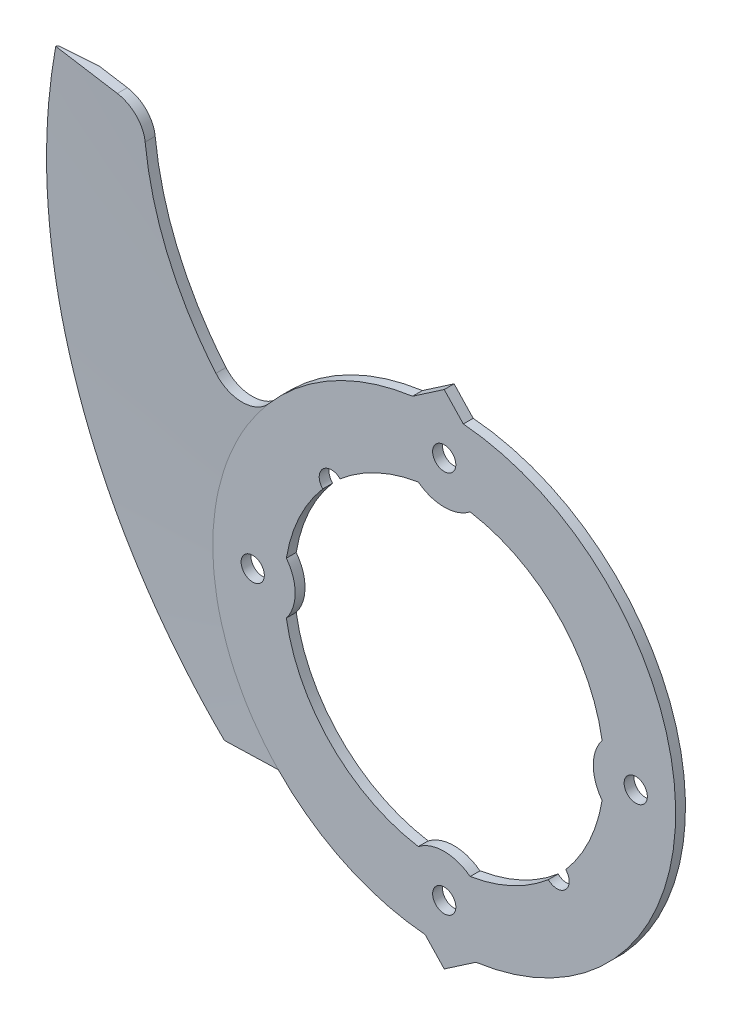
ISO-10303-21;
HEADER;
FILE_DESCRIPTION(('STEP AP214'),'2;1');
FILE_NAME('part.step','',(''),(''),'','','');
FILE_SCHEMA(('AUTOMOTIVE_DESIGN { 1 0 10303 214 1 1 1 1 }'));
ENDSEC;
DATA;
#1=APPLICATION_CONTEXT('core data for automotive mechanical design processes');
#2=APPLICATION_PROTOCOL_DEFINITION('international standard','automotive_design',2000,#1);
#3=PRODUCT_CONTEXT('',#1,'mechanical');
#4=PRODUCT('Part','Part','',(#3));
#5=PRODUCT_RELATED_PRODUCT_CATEGORY('part','',(#4));
#6=PRODUCT_DEFINITION_FORMATION('','',#4);
#7=PRODUCT_DEFINITION_CONTEXT('part definition',#1,'design');
#8=PRODUCT_DEFINITION('design','',#6,#7);
#9=PRODUCT_DEFINITION_SHAPE('','',#8);
#10=(LENGTH_UNIT() NAMED_UNIT(*) SI_UNIT(.MILLI.,.METRE.));
#11=(NAMED_UNIT(*) PLANE_ANGLE_UNIT() SI_UNIT($,.RADIAN.));
#12=(NAMED_UNIT(*) SI_UNIT($,.STERADIAN.) SOLID_ANGLE_UNIT());
#13=UNCERTAINTY_MEASURE_WITH_UNIT(LENGTH_MEASURE(1.E-05),#10,'distance_accuracy_value','');
#14=(GEOMETRIC_REPRESENTATION_CONTEXT(3) GLOBAL_UNCERTAINTY_ASSIGNED_CONTEXT((#13)) GLOBAL_UNIT_ASSIGNED_CONTEXT((#10,
#11,#12)) REPRESENTATION_CONTEXT('',''));
#15=CARTESIAN_POINT('',(0.,0.,0.));
#16=DIRECTION('',(0.,0.,1.));
#17=DIRECTION('',(1.,0.,0.));
#18=AXIS2_PLACEMENT_3D('',#15,#16,#17);
#19=CARTESIAN_POINT('',(2.814039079,31.6919291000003,1.659054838));
#20=DIRECTION('',(0.,0.,-1.));
#21=DIRECTION('',(0.,1.00000000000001,0.));
#22=AXIS2_PLACEMENT_3D('',#19,#20,#21);
#23=CYLINDRICAL_SURFACE('',#22,29.470346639);
#24=CARTESIAN_POINT('',(-26.5814833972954,29.5932177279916,0.731024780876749));
#25=CARTESIAN_POINT('',(-26.5510200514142,29.1665459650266,0.717448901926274));
#26=CARTESIAN_POINT('',(-26.511271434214,28.7405984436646,0.703749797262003));
#27=CARTESIAN_POINT('',(-26.4132777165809,27.8908409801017,0.676107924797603));
#28=CARTESIAN_POINT('',(-26.3550324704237,27.4670310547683,0.662165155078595));
#29=CARTESIAN_POINT('',(-26.1526716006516,26.1999001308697,0.619977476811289));
#30=CARTESIAN_POINT('',(-25.9809273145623,25.3608286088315,0.591371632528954));
#31=CARTESIAN_POINT('',(-25.5701512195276,23.7209399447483,0.533972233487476));
#32=CARTESIAN_POINT('',(-25.3328359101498,22.9196880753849,0.505199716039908));
#33=CARTESIAN_POINT('',(-24.791095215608,21.340394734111,0.446865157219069));
#34=CARTESIAN_POINT('',(-24.4866909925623,20.562346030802,0.417303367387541));
#35=CARTESIAN_POINT('',(-23.9225957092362,19.2834172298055,0.367181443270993));
#36=CARTESIAN_POINT('',(-23.6805417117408,18.7746628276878,0.34681931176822));
#37=CARTESIAN_POINT('',(-23.1677197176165,17.7719245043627,0.305779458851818));
#38=CARTESIAN_POINT('',(-22.8969567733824,17.2779380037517,0.285101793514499));
#39=CARTESIAN_POINT('',(-22.3228499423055,16.2982363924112,0.243101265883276));
#40=CARTESIAN_POINT('',(-22.0190396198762,15.8127949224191,0.221773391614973));
#41=CARTESIAN_POINT('',(-21.383622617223,14.8603338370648,0.178824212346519));
#42=CARTESIAN_POINT('',(-21.0520104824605,14.3933178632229,0.157202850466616));
#43=CARTESIAN_POINT('',(-20.7070520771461,13.9363778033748,0.135446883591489));
#44=B_SPLINE_CURVE_WITH_KNOTS('',3,(#24,#25,#26,#27,#28,#29,#30,#31,#32,#33,#34,#35,#36,#37,#38,
#39,#40,#41,#42,#43),.UNSPECIFIED.,.F.,.F.,(4,2,2,2,2,2,2,2,2,4),(0.,1.28370419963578,
2.56741851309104,5.13469906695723,7.6402739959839,10.1450597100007,11.8355260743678,
13.5256954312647,15.2439361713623,16.9625148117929),.UNSPECIFIED.);
#45=CARTESIAN_POINT('',(-26.5814833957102,29.5932177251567,0.731024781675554));
#46=VERTEX_POINT('',#45);
#47=CARTESIAN_POINT('',(-20.7070520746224,13.9363778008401,0.135446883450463));
#48=VERTEX_POINT('',#47);
#49=EDGE_CURVE('E480',#46,#48,#44,.T.);
#50=ORIENTED_EDGE('',*,*,#49,.F.);
#51=DIRECTION('',(0.,0.,-1.));
#52=VECTOR('',#51,1.);
#53=CARTESIAN_POINT('',(-26.5814833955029,29.5932177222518,1.2635324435));
#54=LINE('',#53,#52);
#55=CARTESIAN_POINT('',(-26.5814833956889,29.5932177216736,1.64996771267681));
#56=VERTEX_POINT('',#55);
#57=EDGE_CURVE('E365',#56,#46,#54,.T.);
#58=ORIENTED_EDGE('',*,*,#57,.F.);
#59=CARTESIAN_POINT('',(-26.5814833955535,29.5932177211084,1.64996771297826));
#60=CARTESIAN_POINT('',(-26.5510200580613,29.1665460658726,1.63637971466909));
#61=CARTESIAN_POINT('',(-26.5112714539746,28.7405986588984,1.62266838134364));
#62=CARTESIAN_POINT('',(-26.4132777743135,27.8908414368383,1.59500183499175));
#63=CARTESIAN_POINT('',(-26.3550325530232,27.4670316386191,1.58104662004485));
#64=CARTESIAN_POINT('',(-26.1526717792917,26.1999011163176,1.53882128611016));
#65=CARTESIAN_POINT('',(-25.9809275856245,25.3608298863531,1.5101899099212));
#66=CARTESIAN_POINT('',(-25.5701517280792,23.720941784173,1.45273928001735));
#67=CARTESIAN_POINT('',(-25.3328365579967,22.9196901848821,1.42394108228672));
#68=CARTESIAN_POINT('',(-24.791096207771,21.3403974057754,1.36555446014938));
#69=CARTESIAN_POINT('',(-24.486692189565,20.562348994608,1.33596628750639));
#70=CARTESIAN_POINT('',(-23.922597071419,19.2834201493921,1.28579961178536));
#71=CARTESIAN_POINT('',(-23.680542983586,18.7746654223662,1.26541928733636));
#72=CARTESIAN_POINT('',(-23.1677207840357,17.771926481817,1.22434276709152));
#73=CARTESIAN_POINT('',(-22.8969577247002,17.2779396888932,1.20364662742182));
#74=CARTESIAN_POINT('',(-22.3228506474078,16.2982375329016,1.16160857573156));
#75=CARTESIAN_POINT('',(-22.01904019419,15.8127958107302,1.14026164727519));
#76=CARTESIAN_POINT('',(-21.3836229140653,14.8603342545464,1.09727409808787));
#77=CARTESIAN_POINT('',(-21.0520106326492,14.393318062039,1.07563342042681));
#78=CARTESIAN_POINT('',(-20.7070520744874,13.9363777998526,1.0538580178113));
#79=B_SPLINE_CURVE_WITH_KNOTS('',3,(#59,#60,#61,#62,#63,#64,#65,#66,#67,#68,#69,#70,#71,#72,#73,
#74,#75,#76,#77,#78),.UNSPECIFIED.,.F.,.F.,(4,2,2,2,2,2,2,2,2,4),(0.,1.28370502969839,
2.56742017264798,5.13470237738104,7.6402790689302,10.145066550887,11.8355358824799,
13.5257082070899,15.2439519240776,16.9625335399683),.UNSPECIFIED.);
#80=CARTESIAN_POINT('',(-20.7070520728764,13.9363777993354,1.05385801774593));
#81=VERTEX_POINT('',#80);
#82=EDGE_CURVE('E462',#56,#81,#79,.T.);
#83=ORIENTED_EDGE('',*,*,#82,.T.);
#84=DIRECTION('',(0.,0.,-1.));
#85=VECTOR('',#84,1.);
#86=CARTESIAN_POINT('',(-20.707052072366,13.9363777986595,0.530090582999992));
#87=LINE('',#86,#85);
#88=EDGE_CURVE('E366',#81,#48,#87,.T.);
#89=ORIENTED_EDGE('',*,*,#88,.T.);
#90=EDGE_LOOP('',(#50,#58,#83,#89));
#91=FACE_BOUND('',#90,.T.);
#92=ADVANCED_FACE('F32',(#91),#23,.F.);
#93=CARTESIAN_POINT('',(-34.3717836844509,33.7291411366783,2.00650313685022));
#94=CARTESIAN_POINT('',(-35.1904418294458,29.7941089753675,1.91965698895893));
#95=CARTESIAN_POINT('',(-35.5687369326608,25.7120647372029,1.83013021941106));
#96=CARTESIAN_POINT('',(-35.3675337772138,16.8775472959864,1.63755945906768));
#97=CARTESIAN_POINT('',(-34.6248666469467,12.1483810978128,1.53497570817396));
#98=CARTESIAN_POINT('',(-31.8289295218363,2.85509416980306,1.33852359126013));
#99=CARTESIAN_POINT('',(-29.8040431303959,-1.57244486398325,1.2470677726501));
#100=CARTESIAN_POINT('',(-25.0323947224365,-9.09484522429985,1.11654711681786));
#101=CARTESIAN_POINT('',(-22.5069031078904,-12.2232591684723,1.07023503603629));
#102=CARTESIAN_POINT('',(-19.6430838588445,-15.0502871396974,1.04632928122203));
#103=CARTESIAN_POINT('',(-34.3700473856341,33.7288495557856,2.00334201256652));
#104=CARTESIAN_POINT('',(-35.1886833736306,29.7939490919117,1.91649587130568));
#105=CARTESIAN_POINT('',(-35.5669713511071,25.7120403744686,1.82696910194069));
#106=CARTESIAN_POINT('',(-35.3657863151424,16.8778134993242,1.63439833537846));
#107=CARTESIAN_POINT('',(-34.623149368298,12.1487998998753,1.53181455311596));
#108=CARTESIAN_POINT('',(-31.8273150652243,2.85581244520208,1.33536242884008));
#109=CARTESIAN_POINT('',(-29.8024972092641,-1.57159068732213,1.2439064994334));
#110=CARTESIAN_POINT('',(-25.0310063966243,-9.09375815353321,1.11338581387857));
#111=CARTESIAN_POINT('',(-22.5055936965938,-12.2220795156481,1.06707364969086));
#112=CARTESIAN_POINT('',(-19.6418620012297,-15.0490232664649,1.04316786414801));
#113=CARTESIAN_POINT('',(-34.3683110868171,33.7285579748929,2.00018088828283));
#114=CARTESIAN_POINT('',(-35.1869249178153,29.7937892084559,1.91333475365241));
#115=CARTESIAN_POINT('',(-35.5652057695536,25.7120160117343,1.82380798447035));
#116=CARTESIAN_POINT('',(-35.3640388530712,16.8780797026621,1.63123721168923));
#117=CARTESIAN_POINT('',(-34.6214320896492,12.1492187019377,1.52865339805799));
#118=CARTESIAN_POINT('',(-31.8257006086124,2.85653072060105,1.33220126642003));
#119=CARTESIAN_POINT('',(-29.8009512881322,-1.57073651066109,1.2407452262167));
#120=CARTESIAN_POINT('',(-25.0296180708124,-9.09267108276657,1.11022451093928));
#121=CARTESIAN_POINT('',(-22.5042842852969,-12.220899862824,1.06391226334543));
#122=CARTESIAN_POINT('',(-19.640640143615,-15.0477593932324,1.040006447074));
#123=CARTESIAN_POINT('',(-34.3665747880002,33.7282663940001,1.99701976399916));
#124=CARTESIAN_POINT('',(-35.185166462,29.793629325,1.91017363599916));
#125=CARTESIAN_POINT('',(-35.563440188,25.711991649,1.82064686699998));
#126=CARTESIAN_POINT('',(-35.362291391,16.878345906,1.628076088));
#127=CARTESIAN_POINT('',(-34.6197148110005,12.1496375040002,1.525492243));
#128=CARTESIAN_POINT('',(-31.8240861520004,2.85724899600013,1.32904010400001));
#129=CARTESIAN_POINT('',(-29.7994053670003,-1.56988233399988,1.237583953));
#130=CARTESIAN_POINT('',(-25.0282297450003,-9.09158401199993,1.107063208));
#131=CARTESIAN_POINT('',(-22.5029748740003,-12.2197202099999,1.060750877));
#132=CARTESIAN_POINT('',(-19.6394182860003,-15.0464955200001,1.03684503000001));
#133=CARTESIAN_POINT('',(-34.328603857,33.721889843,1.92788947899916));
#134=CARTESIAN_POINT('',(-35.1467109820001,29.790132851,1.84104349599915));
#135=CARTESIAN_POINT('',(-35.524828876,25.7114588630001,1.75151673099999));
#136=CARTESIAN_POINT('',(-35.3240763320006,16.8841674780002,1.558945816));
#137=CARTESIAN_POINT('',(-34.5821598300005,12.1587962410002,1.45636128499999));
#138=CARTESIAN_POINT('',(-31.7887797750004,2.87295688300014,1.259908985));
#139=CARTESIAN_POINT('',(-29.7655977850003,-1.55120243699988,1.168450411));
#140=CARTESIAN_POINT('',(-24.997868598,-9.067810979,1.037929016));
#141=CARTESIAN_POINT('',(-22.4743395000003,-12.1939225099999,0.991614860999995));
#142=CARTESIAN_POINT('',(-19.6126976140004,-15.0188560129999,0.967708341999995));
#143=CARTESIAN_POINT('',(-34.290632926,33.715513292,1.85875919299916));
#144=CARTESIAN_POINT('',(-35.1082555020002,29.7866363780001,1.77191335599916));
#145=CARTESIAN_POINT('',(-35.4862175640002,25.7109260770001,1.68238659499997));
#146=CARTESIAN_POINT('',(-35.2858612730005,16.8899890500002,1.48981554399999));
#147=CARTESIAN_POINT('',(-34.5446048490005,12.1679549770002,1.387230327));
#148=CARTESIAN_POINT('',(-31.7534733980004,2.8886647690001,1.19077786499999));
#149=CARTESIAN_POINT('',(-29.7317902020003,-1.53252253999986,1.099316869));
#150=CARTESIAN_POINT('',(-24.9675074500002,-9.04403794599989,0.968794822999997));
#151=CARTESIAN_POINT('',(-22.4457041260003,-12.1681248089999,0.922478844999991));
#152=CARTESIAN_POINT('',(-19.5859769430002,-14.9912165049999,0.898571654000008));
#153=CARTESIAN_POINT('',(-34.2526619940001,33.709136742,1.78962890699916));
#154=CARTESIAN_POINT('',(-35.069800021,29.7831399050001,1.70278321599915));
#155=CARTESIAN_POINT('',(-35.447606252,25.710393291,1.61325645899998));
#156=CARTESIAN_POINT('',(-35.2476462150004,16.8958106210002,1.42068527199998));
#157=CARTESIAN_POINT('',(-34.5070498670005,12.1771137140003,1.31809936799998));
#158=CARTESIAN_POINT('',(-31.7181670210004,2.90437265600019,1.12164674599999));
#159=CARTESIAN_POINT('',(-29.6979826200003,-1.51384264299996,1.030183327));
#160=CARTESIAN_POINT('',(-24.937146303,-9.020264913,0.899660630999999));
#161=CARTESIAN_POINT('',(-22.4170687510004,-12.1423271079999,0.853342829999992));
#162=CARTESIAN_POINT('',(-19.5592562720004,-14.9635769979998,0.829434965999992));
#163=B_SPLINE_SURFACE_WITH_KNOTS('',3,3,((#93,#94,#95,#96,#97,#98,#99,#100,#101,#102),(#103,
#104,#105,#106,#107,#108,#109,#110,#111,#112),(#113,#114,#115,#116,#117,#118,#119,#120,#121,
#122),(#123,#124,#125,#126,#127,#128,#129,#130,#131,#132),(#133,#134,#135,#136,#137,#138,#139,
#140,#141,#142),(#143,#144,#145,#146,#147,#148,#149,#150,#151,#152),(#153,#154,#155,#156,#157,
#158,#159,#160,#161,#162)),.UNSPECIFIED.,.F.,.F.,.F.,(4,3,4),(4,2,2,2,4),(-0.0457270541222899,
0.,1.),(0.0118228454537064,0.0239777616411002,0.0384479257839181,0.052918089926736,
0.0650733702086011),.UNSPECIFIED.);
#164=CARTESIAN_POINT('',(-19.7812485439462,-14.7431763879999,0.831387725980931));
#165=CARTESIAN_POINT('',(-19.7940248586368,-14.7431763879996,0.847682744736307));
#166=CARTESIAN_POINT('',(-19.8067991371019,-14.7431763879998,0.863979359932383));
#167=CARTESIAN_POINT('',(-19.8259575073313,-14.743176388,0.888426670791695));
#168=CARTESIAN_POINT('',(-19.832343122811,-14.743176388,0.896576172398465));
#169=CARTESIAN_POINT('',(-19.8451133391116,-14.743176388,0.912875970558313));
#170=CARTESIAN_POINT('',(-19.8514979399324,-14.7431763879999,0.921026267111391));
#171=CARTESIAN_POINT('',(-19.8642661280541,-14.7431763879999,0.937327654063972));
#172=CARTESIAN_POINT('',(-19.870649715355,-14.743176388,0.945478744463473));
#173=CARTESIAN_POINT('',(-19.8834158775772,-14.743176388,0.961781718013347));
#174=CARTESIAN_POINT('',(-19.8897984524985,-14.7431763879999,0.969933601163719));
#175=CARTESIAN_POINT('',(-19.9025625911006,-14.7431763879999,0.986238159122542));
#176=CARTESIAN_POINT('',(-19.9089441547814,-14.7431763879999,0.994390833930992));
#177=CARTESIAN_POINT('',(-19.9204709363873,-14.743176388,1.00911858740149));
#178=CARTESIAN_POINT('',(-19.9256163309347,-14.7431763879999,1.01569352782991));
#179=CARTESIAN_POINT('',(-19.9359064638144,-14.7431763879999,1.02884392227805));
#180=CARTESIAN_POINT('',(-19.9410512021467,-14.7431763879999,1.03541937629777));
#181=CARTESIAN_POINT('',(-19.9461956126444,-14.7431763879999,1.04199508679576));
#182=B_SPLINE_CURVE_WITH_KNOTS('',3,(#164,#165,#166,#167,#168,#169,#170,#171,#172,#173,#174,
#175,#176,#177,#178,#179,#180,#181),.UNSPECIFIED.,.F.,.F.,(4,2,2,2,2,2,2,2,4),(0.,
0.0621196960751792,0.0931795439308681,0.124239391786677,0.15529923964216,0.186359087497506,
0.217418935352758,0.242465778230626,0.267512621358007),.UNSPECIFIED.);
#183=CARTESIAN_POINT('',(-19.7813237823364,-14.7431094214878,0.831328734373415));
#184=VERTEX_POINT('',#183);
#185=CARTESIAN_POINT('',(-19.9442634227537,-14.7431636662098,1.04350670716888));
#186=VERTEX_POINT('',#185);
#187=EDGE_CURVE('E728',#184,#186,#182,.T.);
#188=CARTESIAN_POINT('',(-19.9474629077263,-14.7463863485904,1.04767640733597));
#189=CARTESIAN_POINT('',(-20.0592721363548,-14.6341745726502,1.04860980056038));
#190=CARTESIAN_POINT('',(-20.1705835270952,-14.5214648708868,1.04957494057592));
#191=CARTESIAN_POINT('',(-20.5030336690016,-14.1818273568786,1.0525646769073));
#192=CARTESIAN_POINT('',(-20.7226612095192,-13.9534179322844,1.05468337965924));
#193=CARTESIAN_POINT('',(-21.1578250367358,-13.492683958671,1.05916581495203));
#194=CARTESIAN_POINT('',(-21.3733607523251,-13.260358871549,1.06152958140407));
#195=CARTESIAN_POINT('',(-22.0149734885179,-12.5562147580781,1.0689937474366));
#196=CARTESIAN_POINT('',(-22.4347154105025,-12.0785961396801,1.07445489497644));
#197=CARTESIAN_POINT('',(-23.2567193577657,-11.1085478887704,1.08628311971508));
#198=CARTESIAN_POINT('',(-23.658980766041,-10.6161177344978,1.09265022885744));
#199=CARTESIAN_POINT('',(-24.4456117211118,-9.61700805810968,1.10623648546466));
#200=CARTESIAN_POINT('',(-24.8299773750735,-9.11032547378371,1.11345581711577));
#201=CARTESIAN_POINT('',(-25.5803090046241,-8.08357923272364,1.12869028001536));
#202=CARTESIAN_POINT('',(-25.9462765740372,-7.56351674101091,1.13670534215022));
#203=CARTESIAN_POINT('',(-26.4835366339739,-6.77052114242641,1.14933888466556));
#204=CARTESIAN_POINT('',(-26.661783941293,-6.50226892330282,1.15368187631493));
#205=CARTESIAN_POINT('',(-27.0134851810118,-5.96264675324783,1.16255272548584));
#206=CARTESIAN_POINT('',(-27.1869392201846,-5.6912768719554,1.16708057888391));
#207=CARTESIAN_POINT('',(-27.5288420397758,-5.14551394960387,1.17630701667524));
#208=CARTESIAN_POINT('',(-27.697292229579,-4.87112179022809,1.18100555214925));
#209=CARTESIAN_POINT('',(-28.0291648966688,-4.31932098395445,1.19056596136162));
#210=CARTESIAN_POINT('',(-28.1925874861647,-4.04191240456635,1.19542783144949));
#211=CARTESIAN_POINT('',(-28.4326222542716,-3.62584933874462,1.20279784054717));
#212=CARTESIAN_POINT('',(-28.5111593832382,-3.48829920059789,1.20524696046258));
#213=CARTESIAN_POINT('',(-28.9008118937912,-2.79871069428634,1.21758629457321));
#214=CARTESIAN_POINT('',(-29.2026843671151,-2.24140591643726,1.22775335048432));
#215=CARTESIAN_POINT('',(-29.78627597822,-1.1163794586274,1.24861978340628));
#216=CARTESIAN_POINT('',(-30.0679951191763,-0.548657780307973,1.25931916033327));
#217=CARTESIAN_POINT('',(-30.6109453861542,0.596496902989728,1.28119696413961));
#218=CARTESIAN_POINT('',(-30.8721765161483,1.17392990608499,1.29237539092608));
#219=CARTESIAN_POINT('',(-31.3738266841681,2.33775718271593,1.31516052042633));
#220=CARTESIAN_POINT('',(-31.6142457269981,2.92415145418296,1.32676722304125));
#221=CARTESIAN_POINT('',(-32.0739803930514,4.10514321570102,1.35036137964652));
#222=CARTESIAN_POINT('',(-32.293296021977,4.6997407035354,1.36234883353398));
#223=CARTESIAN_POINT('',(-32.71057039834,5.89639137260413,1.38666071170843));
#224=CARTESIAN_POINT('',(-32.9085291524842,6.49844455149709,1.39898513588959));
#225=CARTESIAN_POINT('',(-33.189262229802,7.40649691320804,1.41769287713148));
#226=CARTESIAN_POINT('',(-33.2801405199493,7.71001512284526,1.42396575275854));
#227=CARTESIAN_POINT('',(-33.4565681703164,8.31859499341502,1.43658403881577));
#228=CARTESIAN_POINT('',(-33.5421175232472,8.62365665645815,1.44292944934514));
#229=CARTESIAN_POINT('',(-33.7906549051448,9.54103449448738,1.46206439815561));
#230=CARTESIAN_POINT('',(-33.9455394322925,10.155566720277,1.47495313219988));
#231=CARTESIAN_POINT('',(-34.2333013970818,11.3897411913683,1.50095102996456));
#232=CARTESIAN_POINT('',(-34.3661787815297,12.0093834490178,1.51406019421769));
#233=CARTESIAN_POINT('',(-34.6096467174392,13.2530514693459,1.54046256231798));
#234=CARTESIAN_POINT('',(-34.7202372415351,13.8770772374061,1.5537557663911));
#235=CARTESIAN_POINT('',(-34.8692673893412,14.8156979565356,1.57380787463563));
#236=CARTESIAN_POINT('',(-34.9161325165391,15.1289829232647,1.58051022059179));
#237=CARTESIAN_POINT('',(-35.0483062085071,16.0701223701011,1.60067132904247));
#238=CARTESIAN_POINT('',(-35.1251798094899,16.6991864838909,1.61418256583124));
#239=CARTESIAN_POINT('',(-35.256429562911,17.9596302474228,1.64131941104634));
#240=CARTESIAN_POINT('',(-35.3108057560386,18.5910098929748,1.65494501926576));
#241=CARTESIAN_POINT('',(-35.3971440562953,19.8553113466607,1.68229129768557));
#242=CARTESIAN_POINT('',(-35.4291062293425,20.4882331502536,1.69601196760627));
#243=CARTESIAN_POINT('',(-35.4605064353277,21.438135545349,1.71665579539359));
#244=CARTESIAN_POINT('',(-35.4682159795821,21.7548650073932,1.72354773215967));
#245=CARTESIAN_POINT('',(-35.477841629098,22.3884100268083,1.73734055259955));
#246=CARTESIAN_POINT('',(-35.4797578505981,22.7052255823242,1.74424143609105));
#247=CARTESIAN_POINT('',(-35.477856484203,23.3387916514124,1.75805062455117));
#248=CARTESIAN_POINT('',(-35.4740397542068,23.6555421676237,1.76495892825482));
#249=CARTESIAN_POINT('',(-35.4607170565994,24.2889176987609,1.77878271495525));
#250=CARTESIAN_POINT('',(-35.4512110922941,24.6055427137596,1.78569819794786));
#251=CARTESIAN_POINT('',(-35.4142145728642,25.5551933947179,1.80645614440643));
#252=CARTESIAN_POINT('',(-35.3782456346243,26.1879197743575,1.8203084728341));
#253=CARTESIAN_POINT('',(-35.3075181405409,27.1356479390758,1.84109345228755));
#254=CARTESIAN_POINT('',(-35.2811487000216,27.4513116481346,1.84802244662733));
#255=CARTESIAN_POINT('',(-35.1936695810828,28.3976383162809,1.86881341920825));
#256=CARTESIAN_POINT('',(-35.1241933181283,29.0275627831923,1.88267776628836));
#257=CARTESIAN_POINT('',(-35.003319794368,29.970213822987,1.90346222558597));
#258=CARTESIAN_POINT('',(-34.9602551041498,30.2840399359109,1.91038796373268));
#259=CARTESIAN_POINT('',(-34.8685686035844,30.9108831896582,1.92423368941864));
#260=CARTESIAN_POINT('',(-34.8199467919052,31.2239003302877,1.93115367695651));
#261=CARTESIAN_POINT('',(-34.6649314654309,32.1664394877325,1.952008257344));
#262=CARTESIAN_POINT('',(-34.550012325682,32.7945703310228,1.96592987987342));
#263=CARTESIAN_POINT('',(-34.4237385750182,33.4204482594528,1.97982316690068));
#264=B_SPLINE_CURVE_WITH_KNOTS('',3,(#188,#189,#190,#191,#192,#193,#194,#195,#196,#197,#198,
#199,#200,#201,#202,#203,#204,#205,#206,#207,#208,#209,#210,#211,#212,#213,#214,#215,#216,#217,
#218,#219,#220,#221,#222,#223,#224,#225,#226,#227,#228,#229,#230,#231,#232,#233,#234,#235,#236,
#237,#238,#239,#240,#241,#242,#243,#244,#245,#246,#247,#248,#249,#250,#251,#252,#253,#254,#255,
#256,#257,#258,#259,#260,#261,#262,#263),.UNSPECIFIED.,.F.,.F.,(4,2,2,2,2,2,2,2,2,2,2,2,2,2,2,2,
2,2,2,2,2,2,2,2,2,2,2,2,2,2,2,2,2,2,2,2,2,4),(0.,0.475231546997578,1.42580913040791,
2.37651842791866,4.28368281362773,6.19091446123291,8.09855906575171,10.0060381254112,
10.9723049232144,11.9385501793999,12.90452065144,13.8704695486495,14.3457011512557,
16.2469132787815,18.1481251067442,20.049336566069,21.9505475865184,23.8517580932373,
25.7529680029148,26.7036060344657,27.654245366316,29.5554511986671,31.4566616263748,
33.3578743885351,34.3083662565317,36.2095781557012,38.1107866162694,40.0119894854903,
40.9626431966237,41.9132778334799,42.8637702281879,43.8142620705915,45.7154704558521,
46.6659613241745,48.567165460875,49.5176563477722,50.4681474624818,52.3838801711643),.UNSPECIFIED.);
#265=CARTESIAN_POINT('',(-34.4237387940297,33.4204471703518,1.97982314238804));
#266=VERTEX_POINT('',#265);
#267=EDGE_CURVE('E561',#186,#266,#264,.T.);
#268=CARTESIAN_POINT('',(-34.31629099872,33.3987307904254,1.78276298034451));
#269=CARTESIAN_POINT('',(-34.3207679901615,33.399635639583,1.79097382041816));
#270=CARTESIAN_POINT('',(-34.3252449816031,33.4005404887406,1.79918466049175));
#271=CARTESIAN_POINT('',(-34.3341989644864,33.4023501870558,1.81560634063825));
#272=CARTESIAN_POINT('',(-34.338675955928,33.4032550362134,1.82381718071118));
#273=CARTESIAN_POINT('',(-34.3476299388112,33.4050647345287,1.84023886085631));
#274=CARTESIAN_POINT('',(-34.3521069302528,33.4059695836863,1.84844970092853));
#275=CARTESIAN_POINT('',(-34.361060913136,33.4077792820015,1.86487138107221));
#276=CARTESIAN_POINT('',(-34.3655379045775,33.4086841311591,1.87308222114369));
#277=CARTESIAN_POINT('',(-34.3744918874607,33.4104938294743,1.88950390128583));
#278=CARTESIAN_POINT('',(-34.3789688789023,33.4113986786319,1.89771474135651));
#279=CARTESIAN_POINT('',(-34.3879228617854,33.4132083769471,1.91413642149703));
#280=CARTESIAN_POINT('',(-34.3923998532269,33.4141132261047,1.92234726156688));
#281=CARTESIAN_POINT('',(-34.4013538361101,33.4159229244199,1.93876894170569));
#282=CARTESIAN_POINT('',(-34.4058308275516,33.4168277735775,1.94697978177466));
#283=CARTESIAN_POINT('',(-34.4147848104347,33.4186374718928,1.96340146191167));
#284=CARTESIAN_POINT('',(-34.4192618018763,33.4195423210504,1.97161230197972));
#285=CARTESIAN_POINT('',(-34.423738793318,33.420447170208,1.97982314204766));
#286=B_SPLINE_CURVE_WITH_KNOTS('',3,(#268,#269,#270,#271,#272,#273,#274,#275,#276,#277,#278,
#279,#280,#281,#282,#283,#284,#285),.UNSPECIFIED.,.F.,.F.,(4,2,2,2,2,2,2,2,4),(0.,
0.0281872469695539,0.0563744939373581,0.0845617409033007,0.112748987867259,0.140936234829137,
0.169123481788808,0.197310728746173,0.225497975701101),.UNSPECIFIED.);
#287=CARTESIAN_POINT('',(-34.3162661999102,33.3987083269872,1.78286501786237));
#288=VERTEX_POINT('',#287);
#289=EDGE_CURVE('E358',#288,#266,#286,.T.);
#290=CARTESIAN_POINT('',(-19.7812534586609,-14.7430380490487,0.831218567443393));
#291=CARTESIAN_POINT('',(-19.8984524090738,-14.6259747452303,0.832247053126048));
#292=CARTESIAN_POINT('',(-20.0151094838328,-14.5083642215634,0.833313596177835));
#293=CARTESIAN_POINT('',(-20.5957287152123,-13.9175223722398,0.838833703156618));
#294=CARTESIAN_POINT('',(-21.0514611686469,-13.4361529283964,0.843847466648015));
#295=CARTESIAN_POINT('',(-21.9459051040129,-12.4551653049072,0.854994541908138));
#296=CARTESIAN_POINT('',(-22.3845597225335,-11.9554953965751,0.861131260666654));
#297=CARTESIAN_POINT('',(-23.2427140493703,-10.9399555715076,0.874431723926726));
#298=CARTESIAN_POINT('',(-23.6622131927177,-10.4240851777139,0.88159549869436));
#299=CARTESIAN_POINT('',(-24.4818311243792,-9.37647628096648,0.89688845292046));
#300=CARTESIAN_POINT('',(-24.8819335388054,-8.84472496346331,0.905018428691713));
#301=CARTESIAN_POINT('',(-25.4669412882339,-8.03614641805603,0.91788319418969));
#302=CARTESIAN_POINT('',(-25.6594347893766,-7.7647721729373,0.922283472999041));
#303=CARTESIAN_POINT('',(-26.0393444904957,-7.21847515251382,0.931312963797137));
#304=CARTESIAN_POINT('',(-26.2267604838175,-6.94355223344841,0.935942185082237));
#305=CARTESIAN_POINT('',(-26.5983516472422,-6.38743288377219,0.945424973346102));
#306=CARTESIAN_POINT('',(-26.7824737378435,-6.10620101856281,0.950280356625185));
#307=CARTESIAN_POINT('',(-27.1454264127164,-5.54034430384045,0.960160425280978));
#308=CARTESIAN_POINT('',(-27.3242569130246,-5.2557194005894,0.965185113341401));
#309=CARTESIAN_POINT('',(-27.8525379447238,-4.39675550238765,0.980476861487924));
#310=CARTESIAN_POINT('',(-28.1937721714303,-3.81733604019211,0.990961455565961));
#311=CARTESIAN_POINT('',(-28.8540279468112,-2.64582494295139,1.01261098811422));
#312=CARTESIAN_POINT('',(-29.1730440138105,-2.05373022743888,1.0237760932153));
#313=CARTESIAN_POINT('',(-29.7883457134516,-0.857862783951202,1.04678902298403));
#314=CARTESIAN_POINT('',(-30.0846316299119,-0.254090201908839,1.05863683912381));
#315=CARTESIAN_POINT('',(-30.6544454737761,0.965049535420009,1.0829802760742));
#316=CARTESIAN_POINT('',(-30.9279431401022,1.58043081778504,1.09547672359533));
#317=CARTESIAN_POINT('',(-31.4513396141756,2.82113760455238,1.12098233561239));
#318=CARTESIAN_POINT('',(-31.7012382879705,3.44646316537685,1.13399150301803));
#319=CARTESIAN_POINT('',(-32.1770435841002,4.70619255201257,1.16035844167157));
#320=CARTESIAN_POINT('',(-32.4029501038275,5.34059641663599,1.17371621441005));
#321=CARTESIAN_POINT('',(-32.7234917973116,6.29828451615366,1.19380799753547));
#322=CARTESIAN_POINT('',(-32.8272868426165,6.61853042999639,1.20051450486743));
#323=CARTESIAN_POINT('',(-33.0287511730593,7.26094138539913,1.21398764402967));
#324=CARTESIAN_POINT('',(-33.1264205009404,7.58310641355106,1.22075427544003));
#325=CARTESIAN_POINT('',(-33.3610839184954,8.38394891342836,1.23766105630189));
#326=CARTESIAN_POINT('',(-33.4945047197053,8.86367657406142,1.24786454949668));
#327=CARTESIAN_POINT('',(-33.7479177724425,9.82664107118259,1.26843799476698));
#328=CARTESIAN_POINT('',(-33.867910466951,10.3098777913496,1.27880794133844));
#329=CARTESIAN_POINT('',(-34.0942914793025,11.279591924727,1.29967028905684));
#330=CARTESIAN_POINT('',(-34.2006782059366,11.7660697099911,1.31016270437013));
#331=CARTESIAN_POINT('',(-34.3996779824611,12.7418156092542,1.33123491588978));
#332=CARTESIAN_POINT('',(-34.4922909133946,13.231083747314,1.34181471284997));
#333=CARTESIAN_POINT('',(-34.7493067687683,14.7026718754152,1.37363242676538));
#334=CARTESIAN_POINT('',(-34.8928805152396,15.6887488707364,1.39494808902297));
#335=CARTESIAN_POINT('',(-35.0662922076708,17.1720919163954,1.42705385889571));
#336=CARTESIAN_POINT('',(-35.1170917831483,17.6670305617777,1.43777319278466));
#337=CARTESIAN_POINT('',(-35.2048169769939,18.6581562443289,1.45927175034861));
#338=CARTESIAN_POINT('',(-35.2417424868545,19.1543432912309,1.47005097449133));
#339=CARTESIAN_POINT('',(-35.3017908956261,20.1474984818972,1.4916734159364));
#340=CARTESIAN_POINT('',(-35.3249153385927,20.6444665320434,1.50251662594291));
#341=CARTESIAN_POINT('',(-35.3452723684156,21.2659348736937,1.51611547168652));
#342=CARTESIAN_POINT('',(-35.3489164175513,21.3902443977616,1.51883754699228));
#343=CARTESIAN_POINT('',(-35.3553605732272,21.6388847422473,1.52429710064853));
#344=CARTESIAN_POINT('',(-35.3581606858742,21.7632155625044,1.52703457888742));
#345=CARTESIAN_POINT('',(-35.3652084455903,22.1362327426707,1.53524109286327));
#346=CARTESIAN_POINT('',(-35.3681035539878,22.3849450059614,1.54070423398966));
#347=CARTESIAN_POINT('',(-35.3714443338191,23.1309041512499,1.55707076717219));
#348=CARTESIAN_POINT('',(-35.3665524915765,23.6281856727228,1.56795594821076));
#349=CARTESIAN_POINT('',(-35.3426997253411,24.6223883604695,1.5896764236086));
#350=CARTESIAN_POINT('',(-35.3237390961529,25.1193095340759,1.60051171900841));
#351=CARTESIAN_POINT('',(-35.2636818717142,26.2699640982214,1.62558406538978));
#352=CARTESIAN_POINT('',(-35.2174713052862,26.9234373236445,1.6398098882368));
#353=CARTESIAN_POINT('',(-35.1012530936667,28.2280986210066,1.66840867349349));
#354=CARTESIAN_POINT('',(-35.0312509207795,28.8792871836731,1.6827816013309));
#355=CARTESIAN_POINT('',(-34.8676219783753,30.1774537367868,1.71149924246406));
#356=CARTESIAN_POINT('',(-34.7740397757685,30.8244373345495,1.7258439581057));
#357=CARTESIAN_POINT('',(-34.563088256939,32.1146585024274,1.75447375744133));
#358=CARTESIAN_POINT('',(-34.445713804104,32.7578952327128,1.76875882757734));
#359=CARTESIAN_POINT('',(-34.3164144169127,33.3987356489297,1.78298176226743));
#360=B_SPLINE_CURVE_WITH_KNOTS('',3,(#290,#291,#292,#293,#294,#295,#296,#297,#298,#299,#300,
#301,#302,#303,#304,#305,#306,#307,#308,#309,#310,#311,#312,#313,#314,#315,#316,#317,#318,#319,
#320,#321,#322,#323,#324,#325,#326,#327,#328,#329,#330,#331,#332,#333,#334,#335,#336,#337,#338,
#339,#340,#341,#342,#343,#344,#345,#346,#347,#348,#349,#350,#351,#352,#353,#354,#355,#356,#357,
#358,#359),.UNSPECIFIED.,.F.,.F.,(4,2,2,2,2,2,2,2,2,2,2,2,2,2,2,2,2,2,2,2,2,2,2,2,2,2,2,2,2,2,2,
2,2,2,4),(0.,0.496962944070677,2.4851405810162,4.47945339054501,6.47382498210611,
8.46985182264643,9.46802967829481,10.4662480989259,11.4747222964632,12.4832124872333,
14.5002243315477,16.5177320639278,18.5352146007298,20.5553348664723,22.5754665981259,
24.5956069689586,25.6056948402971,26.6157756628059,28.1096945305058,29.6035641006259,
31.0976082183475,32.5916652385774,35.5798614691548,37.0726769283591,38.5655040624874,
40.0581641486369,40.4313409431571,40.8045150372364,41.5508596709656,43.0429118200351,
44.5349327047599,46.500249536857,48.465114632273,50.426293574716,52.3878963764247),.UNSPECIFIED.);
#361=EDGE_CURVE('E148',#184,#288,#360,.T.);
#362=CARTESIAN_POINT('',(-34.3717836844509,33.7291411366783,2.00650313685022));
#363=CARTESIAN_POINT('',(-35.1904418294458,29.7941089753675,1.91965698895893));
#364=CARTESIAN_POINT('',(-35.5687369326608,25.7120647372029,1.83013021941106));
#365=CARTESIAN_POINT('',(-35.3675337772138,16.8775472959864,1.63755945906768));
#366=CARTESIAN_POINT('',(-34.6248666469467,12.1483810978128,1.53497570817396));
#367=CARTESIAN_POINT('',(-31.8289295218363,2.85509416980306,1.33852359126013));
#368=CARTESIAN_POINT('',(-29.8040431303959,-1.57244486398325,1.2470677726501));
#369=CARTESIAN_POINT('',(-25.0323947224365,-9.09484522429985,1.11654711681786));
#370=CARTESIAN_POINT('',(-22.5069031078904,-12.2232591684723,1.07023503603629));
#371=CARTESIAN_POINT('',(-19.6430838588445,-15.0502871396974,1.04632928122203));
#372=CARTESIAN_POINT('',(-34.3700473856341,33.7288495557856,2.00334201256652));
#373=CARTESIAN_POINT('',(-35.1886833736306,29.7939490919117,1.91649587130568));
#374=CARTESIAN_POINT('',(-35.5669713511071,25.7120403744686,1.82696910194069));
#375=CARTESIAN_POINT('',(-35.3657863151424,16.8778134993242,1.63439833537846));
#376=CARTESIAN_POINT('',(-34.623149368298,12.1487998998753,1.53181455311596));
#377=CARTESIAN_POINT('',(-31.8273150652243,2.85581244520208,1.33536242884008));
#378=CARTESIAN_POINT('',(-29.8024972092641,-1.57159068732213,1.2439064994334));
#379=CARTESIAN_POINT('',(-25.0310063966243,-9.09375815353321,1.11338581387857));
#380=CARTESIAN_POINT('',(-22.5055936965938,-12.2220795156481,1.06707364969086));
#381=CARTESIAN_POINT('',(-19.6418620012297,-15.0490232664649,1.04316786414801));
#382=CARTESIAN_POINT('',(-34.3683110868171,33.7285579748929,2.00018088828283));
#383=CARTESIAN_POINT('',(-35.1869249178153,29.7937892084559,1.91333475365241));
#384=CARTESIAN_POINT('',(-35.5652057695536,25.7120160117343,1.82380798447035));
#385=CARTESIAN_POINT('',(-35.3640388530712,16.8780797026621,1.63123721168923));
#386=CARTESIAN_POINT('',(-34.6214320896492,12.1492187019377,1.52865339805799));
#387=CARTESIAN_POINT('',(-31.8257006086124,2.85653072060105,1.33220126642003));
#388=CARTESIAN_POINT('',(-29.8009512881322,-1.57073651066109,1.2407452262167));
#389=CARTESIAN_POINT('',(-25.0296180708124,-9.09267108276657,1.11022451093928));
#390=CARTESIAN_POINT('',(-22.5042842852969,-12.220899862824,1.06391226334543));
#391=CARTESIAN_POINT('',(-19.640640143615,-15.0477593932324,1.040006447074));
#392=CARTESIAN_POINT('',(-34.3665747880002,33.7282663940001,1.99701976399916));
#393=CARTESIAN_POINT('',(-35.185166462,29.793629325,1.91017363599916));
#394=CARTESIAN_POINT('',(-35.563440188,25.711991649,1.82064686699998));
#395=CARTESIAN_POINT('',(-35.362291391,16.878345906,1.628076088));
#396=CARTESIAN_POINT('',(-34.6197148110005,12.1496375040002,1.525492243));
#397=CARTESIAN_POINT('',(-31.8240861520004,2.85724899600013,1.32904010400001));
#398=CARTESIAN_POINT('',(-29.7994053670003,-1.56988233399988,1.237583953));
#399=CARTESIAN_POINT('',(-25.0282297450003,-9.09158401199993,1.107063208));
#400=CARTESIAN_POINT('',(-22.5029748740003,-12.2197202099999,1.060750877));
#401=CARTESIAN_POINT('',(-19.6394182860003,-15.0464955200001,1.03684503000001));
#402=CARTESIAN_POINT('',(-34.328603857,33.721889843,1.92788947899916));
#403=CARTESIAN_POINT('',(-35.1467109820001,29.790132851,1.84104349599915));
#404=CARTESIAN_POINT('',(-35.524828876,25.7114588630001,1.75151673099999));
#405=CARTESIAN_POINT('',(-35.3240763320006,16.8841674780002,1.558945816));
#406=CARTESIAN_POINT('',(-34.5821598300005,12.1587962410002,1.45636128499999));
#407=CARTESIAN_POINT('',(-31.7887797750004,2.87295688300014,1.259908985));
#408=CARTESIAN_POINT('',(-29.7655977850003,-1.55120243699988,1.168450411));
#409=CARTESIAN_POINT('',(-24.997868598,-9.067810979,1.037929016));
#410=CARTESIAN_POINT('',(-22.4743395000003,-12.1939225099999,0.991614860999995));
#411=CARTESIAN_POINT('',(-19.6126976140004,-15.0188560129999,0.967708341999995));
#412=CARTESIAN_POINT('',(-34.290632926,33.715513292,1.85875919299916));
#413=CARTESIAN_POINT('',(-35.1082555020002,29.7866363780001,1.77191335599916));
#414=CARTESIAN_POINT('',(-35.4862175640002,25.7109260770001,1.68238659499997));
#415=CARTESIAN_POINT('',(-35.2858612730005,16.8899890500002,1.48981554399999));
#416=CARTESIAN_POINT('',(-34.5446048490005,12.1679549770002,1.387230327));
#417=CARTESIAN_POINT('',(-31.7534733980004,2.8886647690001,1.19077786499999));
#418=CARTESIAN_POINT('',(-29.7317902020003,-1.53252253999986,1.099316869));
#419=CARTESIAN_POINT('',(-24.9675074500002,-9.04403794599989,0.968794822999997));
#420=CARTESIAN_POINT('',(-22.4457041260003,-12.1681248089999,0.922478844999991));
#421=CARTESIAN_POINT('',(-19.5859769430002,-14.9912165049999,0.898571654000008));
#422=CARTESIAN_POINT('',(-34.2526619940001,33.709136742,1.78962890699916));
#423=CARTESIAN_POINT('',(-35.069800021,29.7831399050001,1.70278321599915));
#424=CARTESIAN_POINT('',(-35.447606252,25.710393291,1.61325645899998));
#425=CARTESIAN_POINT('',(-35.2476462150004,16.8958106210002,1.42068527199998));
#426=CARTESIAN_POINT('',(-34.5070498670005,12.1771137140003,1.31809936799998));
#427=CARTESIAN_POINT('',(-31.7181670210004,2.90437265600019,1.12164674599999));
#428=CARTESIAN_POINT('',(-29.6979826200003,-1.51384264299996,1.030183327));
#429=CARTESIAN_POINT('',(-24.937146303,-9.020264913,0.899660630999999));
#430=CARTESIAN_POINT('',(-22.4170687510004,-12.1423271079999,0.853342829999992));
#431=CARTESIAN_POINT('',(-19.5592562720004,-14.9635769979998,0.829434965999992));
#432=CARTESIAN_POINT('',(-34.2525670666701,33.709120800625,1.78945608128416));
#433=CARTESIAN_POINT('',(-35.0697038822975,29.7831311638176,1.70261039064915));
#434=CARTESIAN_POINT('',(-35.44750972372,25.710391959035,1.61308363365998));
#435=CARTESIAN_POINT('',(-35.2475506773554,16.8958251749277,1.42051244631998));
#436=CARTESIAN_POINT('',(-34.5069559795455,12.1771366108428,1.31792654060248));
#437=CARTESIAN_POINT('',(-31.7180787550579,2.90441192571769,1.12147391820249));
#438=CARTESIAN_POINT('',(-29.6978981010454,-1.51379594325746,1.030010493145));
#439=CARTESIAN_POINT('',(-24.9370704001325,-9.0202054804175,0.899487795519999));
#440=CARTESIAN_POINT('',(-22.4169971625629,-12.1422626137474,0.853169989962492));
#441=CARTESIAN_POINT('',(-19.5591894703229,-14.9635078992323,0.829262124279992));
#442=CARTESIAN_POINT('',(-34.25247213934,33.70910485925,1.78928325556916));
#443=CARTESIAN_POINT('',(-35.069607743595,29.7831224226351,1.70243756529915));
#444=CARTESIAN_POINT('',(-35.44741319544,25.71039062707,1.61291080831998));
#445=CARTESIAN_POINT('',(-35.2474551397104,16.8958397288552,1.42033962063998));
#446=CARTESIAN_POINT('',(-34.5068620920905,12.1771595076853,1.31775371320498));
#447=CARTESIAN_POINT('',(-31.7179904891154,2.90445119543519,1.12130109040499));
#448=CARTESIAN_POINT('',(-29.6978135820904,-1.51374924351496,1.02983765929));
#449=CARTESIAN_POINT('',(-24.936994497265,-9.020146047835,0.899314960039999));
#450=CARTESIAN_POINT('',(-22.4169255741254,-12.1421981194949,0.852997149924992));
#451=CARTESIAN_POINT('',(-19.5591226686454,-14.9634388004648,0.829089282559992));
#452=CARTESIAN_POINT('',(-34.2523772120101,33.709088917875,1.78911042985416));
#453=CARTESIAN_POINT('',(-35.0695116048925,29.7831136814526,1.70226473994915));
#454=CARTESIAN_POINT('',(-35.44731666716,25.710389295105,1.61273798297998));
#455=CARTESIAN_POINT('',(-35.2473596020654,16.8958542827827,1.42016679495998));
#456=CARTESIAN_POINT('',(-34.5067682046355,12.1771824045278,1.31758088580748));
#457=CARTESIAN_POINT('',(-31.7179022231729,2.90449046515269,1.12112826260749));
#458=CARTESIAN_POINT('',(-29.6977290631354,-1.51370254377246,1.029664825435));
#459=CARTESIAN_POINT('',(-24.9369185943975,-9.0200866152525,0.899142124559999));
#460=CARTESIAN_POINT('',(-22.4168539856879,-12.1421336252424,0.852824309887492));
#461=CARTESIAN_POINT('',(-19.5590558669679,-14.9633697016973,0.828916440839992));
#462=B_SPLINE_SURFACE_WITH_KNOTS('',3,3,((#362,#363,#364,#365,#366,#367,#368,#369,#370,#371),
(#372,#373,#374,#375,#376,#377,#378,#379,#380,#381),(#382,#383,#384,#385,#386,#387,#388,#389,
#390,#391),(#392,#393,#394,#395,#396,#397,#398,#399,#400,#401),(#402,#403,#404,#405,#406,#407,
#408,#409,#410,#411),(#412,#413,#414,#415,#416,#417,#418,#419,#420,#421),(#422,#423,#424,#425,
#426,#427,#428,#429,#430,#431),(#432,#433,#434,#435,#436,#437,#438,#439,#440,#441),(#442,#443,
#444,#445,#446,#447,#448,#449,#450,#451),(#452,#453,#454,#455,#456,#457,#458,#459,#460,#461)),
.UNSPECIFIED.,.F.,.F.,.F.,(4,3,3,4),(4,2,2,2,4),(-0.0457270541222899,0.,1.,1.0025),
(0.0118228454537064,0.0239777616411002,0.0384479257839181,0.052918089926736,0.0650733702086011),.UNSPECIFIED.);
#463=ORIENTED_EDGE('',*,*,#187,.T.);
#464=ORIENTED_EDGE('',*,*,#267,.T.);
#465=ORIENTED_EDGE('',*,*,#289,.F.);
#466=ORIENTED_EDGE('',*,*,#361,.F.);
#467=EDGE_LOOP('',(#463,#464,#465,#466));
#468=FACE_BOUND('',#467,.T.);
#469=ADVANCED_FACE('F333',(#468),#462,.T.);
#470=CARTESIAN_POINT('',(-28.9795506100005,32.3201169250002,0.870349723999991));
#471=DIRECTION('',(0.198105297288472,0.980180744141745,0.));
#472=DIRECTION('',(-0.980180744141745,0.198105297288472,0.));
#473=AXIS2_PLACEMENT_3D('',#470,#471,#472);
#474=PLANE('',#473);
#475=DIRECTION('',(0.,0.,1.));
#476=VECTOR('',#475,1.);
#477=CARTESIAN_POINT('',(-28.9795506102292,32.3201169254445,1.2635324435));
#478=LINE('',#477,#476);
#479=CARTESIAN_POINT('',(-28.979550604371,32.3201169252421,0.87696686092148));
#480=VERTEX_POINT('',#479);
#481=CARTESIAN_POINT('',(-28.9795506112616,32.3201169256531,1.79604010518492));
#482=VERTEX_POINT('',#481);
#483=EDGE_CURVE('E370',#480,#482,#478,.T.);
#484=ORIENTED_EDGE('',*,*,#483,.F.);
#485=CARTESIAN_POINT('',(-28.9795505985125,32.3201169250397,0.876966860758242));
#486=CARTESIAN_POINT('',(-29.0822399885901,32.3408717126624,0.880343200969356));
#487=CARTESIAN_POINT('',(-29.1849291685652,32.3616266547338,0.883724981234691));
#488=CARTESIAN_POINT('',(-29.3908323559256,32.403242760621,0.890516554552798));
#489=CARTESIAN_POINT('',(-29.4940463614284,32.4241039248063,0.893926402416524));
#490=CARTESIAN_POINT('',(-29.7010001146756,32.4659324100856,0.900774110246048));
#491=CARTESIAN_POINT('',(-29.8047398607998,32.4868997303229,0.904212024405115));
#492=CARTESIAN_POINT('',(-30.0127459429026,32.52894056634,0.911115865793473));
#493=CARTESIAN_POINT('',(-30.1170122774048,32.550014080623,0.914581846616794));
#494=CARTESIAN_POINT('',(-30.3260723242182,32.5922674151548,0.921541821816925));
#495=CARTESIAN_POINT('',(-30.4308660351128,32.6134472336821,0.92503586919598));
#496=CARTESIAN_POINT('',(-30.6409815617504,32.6559133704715,0.932051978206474));
#497=CARTESIAN_POINT('',(-30.7463033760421,32.6771996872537,0.935574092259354));
#498=CARTESIAN_POINT('',(-30.9574757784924,32.7198790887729,0.942646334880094));
#499=CARTESIAN_POINT('',(-31.0633263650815,32.7412721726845,0.946196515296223));
#500=CARTESIAN_POINT('',(-31.2755569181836,32.784165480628,0.95332489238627));
#501=CARTESIAN_POINT('',(-31.3819368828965,32.805665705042,0.956903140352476));
#502=CARTESIAN_POINT('',(-31.4883166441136,32.8271660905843,0.96048646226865));
#503=B_SPLINE_CURVE_WITH_KNOTS('',3,(#485,#486,#487,#488,#489,#490,#491,#492,#493,#494,#495,
#496,#497,#498,#499,#500,#501,#502),.UNSPECIFIED.,.F.,.F.,(4,2,2,2,2,2,2,2,4),(0.,
0.314460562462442,0.630529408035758,0.948209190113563,1.26750242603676,1.58841150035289,
1.91093866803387,2.23508605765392,2.56085567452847),.UNSPECIFIED.);
#504=CARTESIAN_POINT('',(-31.4883089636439,32.8271645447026,0.960488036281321));
#505=VERTEX_POINT('',#504);
#506=EDGE_CURVE('E369',#505,#480,#503,.F.);
#507=ORIENTED_EDGE('',*,*,#506,.F.);
#508=CARTESIAN_POINT('',(-34.3162436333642,33.3987212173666,1.78293365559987));
#509=CARTESIAN_POINT('',(-33.9655565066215,33.3278434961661,1.68094666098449));
#510=CARTESIAN_POINT('',(-33.6148696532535,33.2569658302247,1.57895868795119));
#511=CARTESIAN_POINT('',(-32.9682048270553,33.1262677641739,1.390891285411));
#512=CARTESIAN_POINT('',(-32.67222677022,33.066447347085,1.30481215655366));
#513=CARTESIAN_POINT('',(-32.0802710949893,32.9468066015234,1.13265232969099));
#514=CARTESIAN_POINT('',(-31.7842934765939,32.8869862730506,1.04657163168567));
#515=CARTESIAN_POINT('',(-31.4883160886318,32.8271659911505,0.960490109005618));
#516=B_SPLINE_CURVE_WITH_KNOTS('',3,(#508,#509,#510,#511,#512,#513,#514,#515),.UNSPECIFIED.,.F.,
.F.,(4,2,2,4),(0.,1.11609055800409,2.05806719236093,3.00004382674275),.UNSPECIFIED.);
#517=EDGE_CURVE('E142',#288,#505,#516,.T.);
#518=ORIENTED_EDGE('',*,*,#517,.F.);
#519=ORIENTED_EDGE('',*,*,#289,.T.);
#520=CARTESIAN_POINT('',(-34.424763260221,33.4206542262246,1.97985851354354));
#521=CARTESIAN_POINT('',(-33.6958668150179,33.273336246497,1.9546938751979));
#522=CARTESIAN_POINT('',(-32.9669636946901,33.1260169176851,1.92972950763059));
#523=CARTESIAN_POINT('',(-31.6949781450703,32.8689346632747,1.88656505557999));
#524=CARTESIAN_POINT('',(-31.1518990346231,32.7591724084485,1.86826308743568));
#525=CARTESIAN_POINT('',(-30.0657317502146,32.5396460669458,1.83193715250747));
#526=CARTESIAN_POINT('',(-29.5226435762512,32.4298819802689,1.8139131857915));
#527=CARTESIAN_POINT('',(-28.9795506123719,32.3201169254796,1.79604010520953));
#528=B_SPLINE_CURVE_WITH_KNOTS('',3,(#520,#521,#522,#523,#524,#525,#526,#527),.UNSPECIFIED.,.F.,
.F.,(4,2,2,4),(0.,2.23218120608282,3.89526824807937,5.55835569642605),.UNSPECIFIED.);
#529=EDGE_CURVE('E348',#266,#482,#528,.T.);
#530=ORIENTED_EDGE('',*,*,#529,.T.);
#531=EDGE_LOOP('',(#484,#507,#518,#519,#530));
#532=FACE_BOUND('',#531,.T.);
#533=ADVANCED_FACE('F497',(#532),#474,.T.);
#534=CARTESIAN_POINT('',(-29.5738665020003,29.3795746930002,1.80243019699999));
#535=DIRECTION('',(0.,0.,-1.));
#536=DIRECTION('',(0.,1.00000000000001,0.));
#537=AXIS2_PLACEMENT_3D('',#534,#535,#536);
#538=CYLINDRICAL_SURFACE('',#537,3.);
#539=ORIENTED_EDGE('',*,*,#483,.T.);
#540=CARTESIAN_POINT('',(-28.9795506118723,32.3201169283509,1.79604010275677));
#541=CARTESIAN_POINT('',(-28.8967916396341,32.303398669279,1.79331690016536));
#542=CARTESIAN_POINT('',(-28.8147484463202,32.2831722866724,1.79051134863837));
#543=CARTESIAN_POINT('',(-28.6526657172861,32.2358840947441,1.78475413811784));
#544=CARTESIAN_POINT('',(-28.5726260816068,32.2088226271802,1.78180248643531));
#545=CARTESIAN_POINT('',(-28.4151545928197,32.1480589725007,1.77577293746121));
#546=CARTESIAN_POINT('',(-28.3377214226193,32.1143602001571,1.77269510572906));
#547=CARTESIAN_POINT('',(-28.1859915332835,32.0405763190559,1.76643307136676));
#548=CARTESIAN_POINT('',(-28.1116947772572,32.0004912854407,1.76324886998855));
#549=CARTESIAN_POINT('',(-27.8942454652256,31.8710144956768,1.75356453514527));
#550=CARTESIAN_POINT('',(-27.7564563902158,31.7723710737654,1.74692970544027));
#551=CARTESIAN_POINT('',(-27.4995256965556,31.5534264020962,1.73349799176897));
#552=CARTESIAN_POINT('',(-27.380378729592,31.4331313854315,1.72670115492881));
#553=CARTESIAN_POINT('',(-27.1639117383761,31.1741755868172,1.71312664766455));
#554=CARTESIAN_POINT('',(-27.0666008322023,31.035507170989,1.70634898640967));
#555=CARTESIAN_POINT('',(-26.8966498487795,30.7437652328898,1.69301252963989));
#556=CARTESIAN_POINT('',(-26.8240120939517,30.5906903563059,1.68645375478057));
#557=CARTESIAN_POINT('',(-26.7142909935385,30.2979950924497,1.6746974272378));
#558=CARTESIAN_POINT('',(-26.6735305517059,30.1597502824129,1.66944233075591));
#559=CARTESIAN_POINT('',(-26.6275653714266,29.9492052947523,1.66188033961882));
#560=CARTESIAN_POINT('',(-26.6147732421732,29.8784988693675,1.65941327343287));
#561=CARTESIAN_POINT('',(-26.5942898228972,29.7363369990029,1.65459806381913));
#562=CARTESIAN_POINT('',(-26.5865992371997,29.6648814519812,1.65224993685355));
#563=CARTESIAN_POINT('',(-26.5814833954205,29.5932177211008,1.64996771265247));
#564=B_SPLINE_CURVE_WITH_KNOTS('',3,(#540,#541,#542,#543,#544,#545,#546,#547,#548,#549,#550,
#551,#552,#553,#554,#555,#556,#557,#558,#559,#560,#561,#562,#563),.UNSPECIFIED.,.F.,.F.,(4,2,2,
2,2,2,2,2,2,2,2,4),(0.,0.253341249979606,0.506669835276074,0.759868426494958,1.01306403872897,
1.5192090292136,2.02520854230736,2.53141895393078,3.03767700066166,3.46878858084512,
3.68431536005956,3.89987188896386),.UNSPECIFIED.);
#565=EDGE_CURVE('E412',#482,#56,#564,.T.);
#566=ORIENTED_EDGE('',*,*,#565,.T.);
#567=ORIENTED_EDGE('',*,*,#57,.T.);
#568=CARTESIAN_POINT('',(-28.9795506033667,32.3201169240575,0.876966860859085));
#569=CARTESIAN_POINT('',(-28.8967917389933,32.3033986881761,0.874246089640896));
#570=CARTESIAN_POINT('',(-28.8147486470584,32.283172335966,0.871443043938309));
#571=CARTESIAN_POINT('',(-28.6526661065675,32.235884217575,0.865690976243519));
#572=CARTESIAN_POINT('',(-28.5726265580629,32.2088227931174,0.862741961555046));
#573=CARTESIAN_POINT('',(-28.4151552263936,32.1480592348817,0.856717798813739));
#574=CARTESIAN_POINT('',(-28.3377221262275,32.1143605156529,0.853642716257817));
#575=CARTESIAN_POINT('',(-28.1859923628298,32.0405767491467,0.847386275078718));
#576=CARTESIAN_POINT('',(-28.1116956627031,32.0004917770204,0.844204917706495));
#577=CARTESIAN_POINT('',(-27.8942464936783,31.8710151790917,0.834529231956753));
#578=CARTESIAN_POINT('',(-27.7564574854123,31.7723718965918,0.827900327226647));
#579=CARTESIAN_POINT('',(-27.4995268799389,31.553427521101,0.814480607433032));
#580=CARTESIAN_POINT('',(-27.3803799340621,31.4331326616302,0.807689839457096));
#581=CARTESIAN_POINT('',(-27.1639130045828,31.1741772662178,0.794127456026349));
#582=CARTESIAN_POINT('',(-27.0666021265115,31.0355091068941,0.787355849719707));
#583=CARTESIAN_POINT('',(-26.896651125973,30.7437677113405,0.77403130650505));
#584=CARTESIAN_POINT('',(-26.8240133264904,30.5906931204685,0.767478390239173));
#585=CARTESIAN_POINT('',(-26.7142917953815,30.2979976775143,0.755732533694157));
#586=CARTESIAN_POINT('',(-26.6735310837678,30.1597523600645,0.750482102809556));
#587=CARTESIAN_POINT('',(-26.6275656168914,29.9492065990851,0.742926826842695));
#588=CARTESIAN_POINT('',(-26.6147734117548,29.8784999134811,0.740461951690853));
#589=CARTESIAN_POINT('',(-26.5942898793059,29.7363375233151,0.735651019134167));
#590=CARTESIAN_POINT('',(-26.5865992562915,29.664881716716,0.733304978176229));
#591=CARTESIAN_POINT('',(-26.5814833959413,29.5932177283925,0.731024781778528));
#592=B_SPLINE_CURVE_WITH_KNOTS('',3,(#568,#569,#570,#571,#572,#573,#574,#575,#576,#577,#578,
#579,#580,#581,#582,#583,#584,#585,#586,#587,#588,#589,#590,#591),.UNSPECIFIED.,.F.,.F.,(4,2,2,
2,2,2,2,2,2,2,2,4),(0.,0.253340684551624,0.50666870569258,0.759866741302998,1.01306179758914,
1.5192056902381,2.02520409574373,2.53141310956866,3.03766977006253,3.46878250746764,
3.68430986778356,3.89986697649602),.UNSPECIFIED.);
#593=EDGE_CURVE('E485',#480,#46,#592,.T.);
#594=ORIENTED_EDGE('',*,*,#593,.F.);
#595=EDGE_LOOP('',(#539,#566,#567,#594));
#596=FACE_BOUND('',#595,.T.);
#597=ADVANCED_FACE('F338',(#596),#538,.T.);
#598=CARTESIAN_POINT('',(-18.3126698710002,15.7438439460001,1.06018116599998));
#599=DIRECTION('',(0.,0.,-1.));
#600=DIRECTION('',(0.,1.00000000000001,0.));
#601=AXIS2_PLACEMENT_3D('',#598,#599,#600);
#602=CYLINDRICAL_SURFACE('',#601,3.);
#603=ORIENTED_EDGE('',*,*,#88,.F.);
#604=CARTESIAN_POINT('',(-20.7070520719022,13.9363778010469,1.05385801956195));
#605=CARTESIAN_POINT('',(-20.6561800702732,13.8689733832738,1.05064640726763));
#606=CARTESIAN_POINT('',(-20.6024527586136,13.8037314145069,1.04738971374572));
#607=CARTESIAN_POINT('',(-20.4896974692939,13.6780103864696,1.04080777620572));
#608=CARTESIAN_POINT('',(-20.4306697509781,13.6175310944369,1.03748253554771));
#609=CARTESIAN_POINT('',(-20.3077609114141,13.5018066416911,1.03078710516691));
#610=CARTESIAN_POINT('',(-20.2438831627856,13.4465579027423,1.02741694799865));
#611=CARTESIAN_POINT('',(-20.1117225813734,13.3416496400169,1.0206535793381));
#612=CARTESIAN_POINT('',(-20.0434398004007,13.2919900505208,1.01726036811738));
#613=CARTESIAN_POINT('',(-19.8326161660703,13.1518999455,1.00707773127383));
#614=CARTESIAN_POINT('',(-19.6840463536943,13.070307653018,1.00028238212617));
#615=CARTESIAN_POINT('',(-19.3754102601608,12.9333055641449,0.986893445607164));
#616=CARTESIAN_POINT('',(-19.2153461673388,12.8778907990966,0.980299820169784));
#617=CARTESIAN_POINT('',(-18.8881398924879,12.7947232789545,0.967514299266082));
#618=CARTESIAN_POINT('',(-18.7209974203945,12.766971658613,0.961322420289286));
#619=CARTESIAN_POINT('',(-18.3843936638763,12.7399511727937,0.949548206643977));
#620=CARTESIAN_POINT('',(-18.2149321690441,12.7406849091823,0.943965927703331));
#621=CARTESIAN_POINT('',(-17.8786398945,12.7706141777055,0.933613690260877));
#622=CARTESIAN_POINT('',(-17.7118073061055,12.7997891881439,0.928843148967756));
#623=CARTESIAN_POINT('',(-17.3853382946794,12.885776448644,0.920288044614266));
#624=CARTESIAN_POINT('',(-17.2257038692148,12.9425963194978,0.916503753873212));
#625=CARTESIAN_POINT('',(-16.9182955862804,13.0822214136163,0.91007358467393));
#626=CARTESIAN_POINT('',(-16.7705187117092,13.1650200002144,0.907427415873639));
#627=CARTESIAN_POINT('',(-16.4911088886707,13.3542233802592,0.903384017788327));
#628=CARTESIAN_POINT('',(-16.3594503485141,13.4605899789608,0.901984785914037));
#629=CARTESIAN_POINT('',(-16.2027493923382,13.6106292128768,0.901020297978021));
#630=CARTESIAN_POINT('',(-16.1685299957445,13.6450288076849,0.900858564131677));
#631=CARTESIAN_POINT('',(-16.1018521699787,13.7153906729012,0.900643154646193));
#632=CARTESIAN_POINT('',(-16.0693910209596,13.7513503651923,0.900589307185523));
#633=CARTESIAN_POINT('',(-16.037804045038,13.7880869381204,0.900589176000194));
#634=B_SPLINE_CURVE_WITH_KNOTS('',3,(#604,#605,#606,#607,#608,#609,#610,#611,#612,#613,#614,
#615,#616,#617,#618,#619,#620,#621,#622,#623,#624,#625,#626,#627,#628,#629,#630,#631,#632,#633),
.UNSPECIFIED.,.F.,.F.,(4,2,2,2,2,2,2,2,2,2,2,2,2,2,4),(0.,0.253441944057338,0.506871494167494,
0.760126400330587,1.01337832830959,1.51966384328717,2.02585322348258,2.53206336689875,
3.03831974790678,3.54421111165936,4.05024201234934,4.55614374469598,5.06123152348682,
5.20675807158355,5.35205266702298),.UNSPECIFIED.);
#635=CARTESIAN_POINT('',(-16.0378040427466,13.7880869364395,0.900252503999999));
#636=VERTEX_POINT('',#635);
#637=EDGE_CURVE('E461',#81,#636,#634,.T.);
#638=ORIENTED_EDGE('',*,*,#637,.T.);
#639=DIRECTION('',(0.,0.,1.));
#640=VECTOR('',#639,1.);
#641=CARTESIAN_POINT('',(-16.0378040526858,13.7880869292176,0.450000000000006));
#642=LINE('',#641,#640);
#643=CARTESIAN_POINT('',(-16.037804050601,13.7880869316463,0.));
#644=VERTEX_POINT('',#643);
#645=EDGE_CURVE('E425',#644,#636,#642,.T.);
#646=ORIENTED_EDGE('',*,*,#645,.F.);
#647=CARTESIAN_POINT('',(-18.3126698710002,15.7438439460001,0.));
#648=DIRECTION('',(0.,0.,-1.));
#649=DIRECTION('',(0.,1.00000000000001,0.));
#650=AXIS2_PLACEMENT_3D('',#647,#648,#649);
#651=CIRCLE('',#650,3.);
#652=CARTESIAN_POINT('',(-17.2966255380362,12.9211406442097,1.36751721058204E-10));
#653=VERTEX_POINT('',#652);
#654=EDGE_CURVE('E277',#644,#653,#651,.T.);
#655=ORIENTED_EDGE('',*,*,#654,.T.);
#656=CARTESIAN_POINT('',(-20.7070520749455,13.9363778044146,0.135446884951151));
#657=CARTESIAN_POINT('',(-20.6561836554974,13.8689781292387,0.13223836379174));
#658=CARTESIAN_POINT('',(-20.6024603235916,13.8037405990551,0.128984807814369));
#659=CARTESIAN_POINT('',(-20.4897136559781,13.678027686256,0.122409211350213));
#660=CARTESIAN_POINT('',(-20.4306905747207,13.6175520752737,0.119087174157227));
#661=CARTESIAN_POINT('',(-20.3077832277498,13.5018262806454,0.112397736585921));
#662=CARTESIAN_POINT('',(-20.2439016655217,13.4465732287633,0.10903036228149));
#663=CARTESIAN_POINT('',(-20.1117328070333,13.3416571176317,0.102272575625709));
#664=CARTESIAN_POINT('',(-20.0434455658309,13.2919939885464,0.0988821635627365));
#665=CARTESIAN_POINT('',(-19.8326151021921,13.1518990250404,0.088708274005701));
#666=CARTESIAN_POINT('',(-19.6840432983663,13.0703053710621,0.0819188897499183));
#667=CARTESIAN_POINT('',(-19.3754056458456,12.9333044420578,0.0685418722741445));
#668=CARTESIAN_POINT('',(-19.2153424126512,12.8778912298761,0.0619541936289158));
#669=CARTESIAN_POINT('',(-18.8881296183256,12.7947192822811,0.0491797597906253));
#670=CARTESIAN_POINT('',(-18.7209789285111,12.7669649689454,0.0429930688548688));
#671=CARTESIAN_POINT('',(-18.384351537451,12.7399529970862,0.0312287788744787));
#672=CARTESIAN_POINT('',(-18.2148750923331,12.7406922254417,0.0256511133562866));
#673=CARTESIAN_POINT('',(-17.9187664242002,12.7670413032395,0.0165439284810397));
#674=CARTESIAN_POINT('',(-17.7915739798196,12.786665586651,0.0128434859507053));
#675=CARTESIAN_POINT('',(-17.540879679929,12.8419741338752,0.00599256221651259));
#676=CARTESIAN_POINT('',(-17.4173735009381,12.8776387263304,0.00284141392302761));
#677=CARTESIAN_POINT('',(-17.296625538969,12.9211406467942,3.50830475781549E-11));
#678=B_SPLINE_CURVE_WITH_KNOTS('',3,(#656,#657,#658,#659,#660,#661,#662,#663,#664,#665,#666,
#667,#668,#669,#670,#671,#672,#673,#674,#675,#676,#677),.UNSPECIFIED.,.F.,.F.,(4,2,2,2,2,2,2,2,
2,2,4),(0.,0.253423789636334,0.506835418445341,0.760107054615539,1.01337552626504,
1.51966901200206,2.02584762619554,2.53210715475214,3.03831137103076,3.42354758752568,
3.8083126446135),.UNSPECIFIED.);
#679=EDGE_CURVE('E479',#48,#653,#678,.T.);
#680=ORIENTED_EDGE('',*,*,#679,.F.);
#681=EDGE_LOOP('',(#603,#638,#646,#655,#680));
#682=FACE_BOUND('',#681,.T.);
#683=ADVANCED_FACE('F467',(#682),#602,.F.);
#684=CARTESIAN_POINT('',(0.,0.,2.73503442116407E-10));
#685=DIRECTION('',(0.,0.,1.));
#686=DIRECTION('',(1.00000000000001,0.,0.));
#687=AXIS2_PLACEMENT_3D('',#684,#685,#686);
#688=CONICAL_SURFACE('',#687,21.5900238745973,1.53062643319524);
#689=ORIENTED_EDGE('',*,*,#49,.T.);
#690=ORIENTED_EDGE('',*,*,#679,.T.);
#691=CARTESIAN_POINT('',(0.,0.,2.73503581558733E-10));
#692=DIRECTION('',(0.,0.,1.));
#693=DIRECTION('',(-0.801139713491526,0.598477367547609,0.));
#694=AXIS2_PLACEMENT_3D('',#691,#692,#693);
#695=CIRCLE('',#694,21.5900238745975);
#696=CARTESIAN_POINT('',(-16.5531163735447,-13.8605795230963,-4.11028372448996E-06));
#697=VERTEX_POINT('',#696);
#698=EDGE_CURVE('E269',#653,#697,#695,.T.);
#699=ORIENTED_EDGE('',*,*,#698,.T.);
#700=CARTESIAN_POINT('',(-31.4883018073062,32.8271632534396,0.960485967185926));
#701=CARTESIAN_POINT('',(-31.5883991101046,32.3316859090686,0.948899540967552));
#702=CARTESIAN_POINT('',(-31.681024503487,31.834685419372,0.93728956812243));
#703=CARTESIAN_POINT('',(-31.851260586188,30.8382344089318,0.914035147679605));
#704=CARTESIAN_POINT('',(-31.928874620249,30.3387844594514,0.902390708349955));
#705=CARTESIAN_POINT('',(-32.0340777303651,29.5876052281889,0.884893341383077));
#706=CARTESIAN_POINT('',(-32.067300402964,29.3366532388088,0.879050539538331));
#707=CARTESIAN_POINT('',(-32.1300001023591,28.8342836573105,0.867360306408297));
#708=CARTESIAN_POINT('',(-32.1594771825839,28.5828660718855,0.86151287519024));
#709=CARTESIAN_POINT('',(-32.2145800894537,28.0795539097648,0.849809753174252));
#710=CARTESIAN_POINT('',(-32.2402050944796,27.8276592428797,0.843954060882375));
#711=CARTESIAN_POINT('',(-32.2875952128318,27.3235009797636,0.832236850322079));
#712=CARTESIAN_POINT('',(-32.3093601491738,27.0712373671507,0.826375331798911));
#713=CARTESIAN_POINT('',(-32.3846731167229,26.1139296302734,0.8041396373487));
#714=CARTESIAN_POINT('',(-32.4252617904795,25.4077998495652,0.787754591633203));
#715=CARTESIAN_POINT('',(-32.4639906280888,24.3478351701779,0.763190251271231));
#716=CARTESIAN_POINT('',(-32.4732077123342,23.9943537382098,0.755003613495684));
#717=CARTESIAN_POINT('',(-32.4842164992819,23.2872705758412,0.738637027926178));
#718=CARTESIAN_POINT('',(-32.4860082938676,22.9336688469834,0.730457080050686));
#719=CARTESIAN_POINT('',(-32.482086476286,22.2263619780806,0.714102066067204));
#720=CARTESIAN_POINT('',(-32.4763698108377,21.8726568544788,0.705927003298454));
#721=CARTESIAN_POINT('',(-32.4620920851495,21.3422570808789,0.693671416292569));
#722=CARTESIAN_POINT('',(-32.4563823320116,21.1654823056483,0.689587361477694));
#723=CARTESIAN_POINT('',(-32.4431262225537,20.8120008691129,0.681424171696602));
#724=CARTESIAN_POINT('',(-32.4355798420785,20.6352942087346,0.677345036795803));
#725=CARTESIAN_POINT('',(-32.3932149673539,19.7520417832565,0.656962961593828));
#726=CARTESIAN_POINT('',(-32.3444893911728,19.0460981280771,0.640695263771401));
#727=CARTESIAN_POINT('',(-32.2172025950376,17.6360347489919,0.608250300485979));
#728=CARTESIAN_POINT('',(-32.1386035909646,16.9319184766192,0.592073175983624));
#729=CARTESIAN_POINT('',(-31.9517195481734,15.5276041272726,0.559870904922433));
#730=CARTESIAN_POINT('',(-31.8434337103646,14.8274061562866,0.543845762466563));
#731=CARTESIAN_POINT('',(-31.5974184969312,13.4322436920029,0.511996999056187));
#732=CARTESIAN_POINT('',(-31.4596907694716,12.7372789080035,0.496173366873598));
#733=CARTESIAN_POINT('',(-31.1549791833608,11.3538248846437,0.464776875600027));
#734=CARTESIAN_POINT('',(-30.9879974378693,10.6653351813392,0.449203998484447));
#735=CARTESIAN_POINT('',(-30.6856456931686,9.52450508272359,0.423511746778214));
#736=CARTESIAN_POINT('',(-30.5583182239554,9.07002052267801,0.413306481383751));
#737=CARTESIAN_POINT('',(-30.3577829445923,8.39112458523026,0.398115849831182));
#738=CARTESIAN_POINT('',(-30.2893475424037,8.16529889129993,0.393071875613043));
#739=CARTESIAN_POINT('',(-30.1492945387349,7.71463535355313,0.383024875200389));
#740=CARTESIAN_POINT('',(-30.0776769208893,7.48979751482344,0.378021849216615));
#741=CARTESIAN_POINT('',(-29.8582488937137,6.81675183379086,0.363084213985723));
#742=CARTESIAN_POINT('',(-29.7058665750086,6.37002284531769,0.353221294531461));
#743=CARTESIAN_POINT('',(-29.3887622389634,5.48096458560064,0.333699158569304));
#744=CARTESIAN_POINT('',(-29.2240401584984,5.03863533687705,0.324039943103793));
#745=CARTESIAN_POINT('',(-28.8821934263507,4.15878980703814,0.304941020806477));
#746=CARTESIAN_POINT('',(-28.7050689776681,3.72127344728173,0.295501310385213));
#747=CARTESIAN_POINT('',(-28.3384349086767,2.85147888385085,0.276861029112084));
#748=CARTESIAN_POINT('',(-28.1489253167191,2.41920066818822,0.267660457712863));
#749=CARTESIAN_POINT('',(-27.5621687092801,1.13140706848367,0.240462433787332));
#750=CARTESIAN_POINT('',(-27.1464062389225,0.284191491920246,0.222852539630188));
#751=CARTESIAN_POINT('',(-26.4870064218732,-0.967588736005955,0.197392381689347));
#752=CARTESIAN_POINT('',(-26.2612383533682,-1.38168953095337,0.189064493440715));
#753=CARTESIAN_POINT('',(-25.7980496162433,-2.20335204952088,0.172761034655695));
#754=CARTESIAN_POINT('',(-25.560628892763,-2.61091374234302,0.164785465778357));
#755=CARTESIAN_POINT('',(-25.0745442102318,-3.4191614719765,0.149227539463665));
#756=CARTESIAN_POINT('',(-24.82588271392,-3.81984898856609,0.141645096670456));
#757=CARTESIAN_POINT('',(-24.4447282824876,-4.41564909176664,0.130597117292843));
#758=CARTESIAN_POINT('',(-24.3163149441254,-4.61337946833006,0.126968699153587));
#759=CARTESIAN_POINT('',(-24.0568344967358,-5.00709317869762,0.119826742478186));
#760=CARTESIAN_POINT('',(-23.9257673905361,-5.20307651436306,0.116313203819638));
#761=CARTESIAN_POINT('',(-23.5319346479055,-5.7831175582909,0.106034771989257));
#762=CARTESIAN_POINT('',(-23.2651975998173,-6.16449340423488,0.0994351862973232));
#763=CARTESIAN_POINT('',(-22.7212374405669,-6.91968744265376,0.0867134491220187));
#764=CARTESIAN_POINT('',(-22.4440143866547,-7.29350567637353,0.0805912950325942));
#765=CARTESIAN_POINT('',(-21.8793239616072,-8.03318117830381,0.0688573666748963));
#766=CARTESIAN_POINT('',(-21.5918593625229,-8.399040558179,0.0632454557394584));
#767=CARTESIAN_POINT('',(-21.0068438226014,-9.12258905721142,0.0525623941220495));
#768=CARTESIAN_POINT('',(-20.7092928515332,-9.48027815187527,0.0474912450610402));
#769=CARTESIAN_POINT('',(-19.8026216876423,-10.5397552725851,0.0331495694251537));
#770=CARTESIAN_POINT('',(-19.1786775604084,-11.2290084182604,0.0247339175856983));
#771=CARTESIAN_POINT('',(-18.2147842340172,-12.2361129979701,0.0140009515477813));
#772=CARTESIAN_POINT('',(-17.8887522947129,-12.5674186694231,0.0107378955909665));
#773=CARTESIAN_POINT('',(-17.2276403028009,-13.2208811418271,0.00486686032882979));
#774=CARTESIAN_POINT('',(-16.8925602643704,-13.5430379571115,0.00225887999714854));
#775=CARTESIAN_POINT('',(-16.5530758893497,-13.8605361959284,-9.62960058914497E-06));
#776=B_SPLINE_CURVE_WITH_KNOTS('',3,(#700,#701,#702,#703,#704,#705,#706,#707,#708,#709,#710,
#711,#712,#713,#714,#715,#716,#717,#718,#719,#720,#721,#722,#723,#724,#725,#726,#727,#728,#729,
#730,#731,#732,#733,#734,#735,#736,#737,#738,#739,#740,#741,#742,#743,#744,#745,#746,#747,#748,
#749,#750,#751,#752,#753,#754,#755,#756,#757,#758,#759,#760,#761,#762,#763,#764,#765,#766,#767,
#768,#769,#770,#771,#772,#773,#774,#775),.UNSPECIFIED.,.F.,.F.,(4,2,2,2,2,2,2,2,2,2,2,2,2,2,2,2,
2,2,2,2,2,2,2,2,2,2,2,2,2,2,2,2,2,2,2,2,2,4),(0.,1.51683079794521,3.03332323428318,
3.79292649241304,4.55251891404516,5.3122731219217,6.07206215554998,8.19374986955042,
9.25478286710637,10.3158027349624,11.3772541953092,11.9079869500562,12.4387266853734,
14.5614449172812,16.6868569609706,18.8123262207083,20.9376765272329,23.0628733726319,
24.4789718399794,25.1870139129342,25.8950596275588,27.3111855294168,28.727318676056,
30.1434286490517,31.5595353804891,34.3893664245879,35.804383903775,37.219408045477,
38.6341236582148,39.3414974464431,40.0488704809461,41.4450115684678,42.8411450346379,
44.2369034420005,45.6326660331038,48.4202131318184,49.8145716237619,51.208927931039),.UNSPECIFIED.);
#777=EDGE_CURVE('E738',#505,#697,#776,.T.);
#778=ORIENTED_EDGE('',*,*,#777,.F.);
#779=ORIENTED_EDGE('',*,*,#506,.T.);
#780=ORIENTED_EDGE('',*,*,#593,.T.);
#781=EDGE_LOOP('',(#689,#690,#699,#778,#779,#780));
#782=FACE_BOUND('',#781,.T.);
#783=ADVANCED_FACE('F292',(#782),#688,.T.);
#784=CARTESIAN_POINT('',(-15.3456655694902,-14.91531842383,-0.0147550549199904));
#785=CARTESIAN_POINT('',(-18.6282276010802,-12.0345231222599,-0.000861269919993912));
#786=CARTESIAN_POINT('',(-21.5203200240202,-8.74770974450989,0.0439889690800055));
#787=CARTESIAN_POINT('',(-26.6051872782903,-1.14296964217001,0.180795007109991));
#788=CARTESIAN_POINT('',(-28.6263340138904,3.04725701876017,0.270709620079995));
#789=CARTESIAN_POINT('',(-30.7888831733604,9.81120652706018,0.421206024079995));
#790=CARTESIAN_POINT('',(-31.3453246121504,12.1004143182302,0.473145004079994));
#791=CARTESIAN_POINT('',(-32.1321049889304,16.7095869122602,0.578493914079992));
#792=CARTESIAN_POINT('',(-32.3644044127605,19.0370117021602,0.632100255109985));
#793=CARTESIAN_POINT('',(-32.5036565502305,23.7337337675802,0.740647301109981));
#794=CARTESIAN_POINT('',(-32.4058002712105,26.1133783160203,0.795843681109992));
#795=CARTESIAN_POINT('',(-31.9692308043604,30.0198129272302,0.886758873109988));
#796=CARTESIAN_POINT('',(-31.7180955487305,31.5907075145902,0.923406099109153));
#797=CARTESIAN_POINT('',(-31.3929887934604,33.1469196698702,0.959833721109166));
#798=CARTESIAN_POINT('',(-15.3520255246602,-14.9225831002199,-0.011998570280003));
#799=CARTESIAN_POINT('',(-18.6352091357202,-12.0412447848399,0.00189521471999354));
#800=CARTESIAN_POINT('',(-21.5278539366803,-8.75381344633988,0.0467454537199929));
#801=CARTESIAN_POINT('',(-26.6137016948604,-1.14763440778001,0.183551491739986));
#802=CARTESIAN_POINT('',(-28.6352429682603,3.04338940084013,0.273466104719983));
#803=CARTESIAN_POINT('',(-30.7982181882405,9.80863199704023,0.423962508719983));
#804=CARTESIAN_POINT('',(-31.3547702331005,12.0982783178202,0.475901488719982));
#805=CARTESIAN_POINT('',(-32.1417089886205,16.7083352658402,0.581250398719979));
#806=CARTESIAN_POINT('',(-32.3740565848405,19.0362072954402,0.634856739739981));
#807=CARTESIAN_POINT('',(-32.5133421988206,23.7338329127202,0.743403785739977));
#808=CARTESIAN_POINT('',(-32.4154703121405,26.1139357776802,0.798600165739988));
#809=CARTESIAN_POINT('',(-31.9788217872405,30.0211233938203,0.889515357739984));
#810=CARTESIAN_POINT('',(-31.7276401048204,31.5923209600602,0.926162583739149));
#811=CARTESIAN_POINT('',(-31.4024725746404,33.1488334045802,0.962590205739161));
#812=CARTESIAN_POINT('',(-15.3583854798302,-14.9298477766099,-0.00924208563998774));
#813=CARTESIAN_POINT('',(-18.6421906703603,-12.0479664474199,0.00465169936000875));
#814=CARTESIAN_POINT('',(-21.5353878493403,-8.75991714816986,0.0495019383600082));
#815=CARTESIAN_POINT('',(-26.6222161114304,-1.15229917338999,0.186307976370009));
#816=CARTESIAN_POINT('',(-28.6441519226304,3.03952178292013,0.276222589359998));
#817=CARTESIAN_POINT('',(-30.8075532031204,9.80605746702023,0.426718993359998));
#818=CARTESIAN_POINT('',(-31.3642158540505,12.0961423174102,0.478657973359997));
#819=CARTESIAN_POINT('',(-32.1513129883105,16.7070836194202,0.584006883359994));
#820=CARTESIAN_POINT('',(-32.3837087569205,19.0354028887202,0.637613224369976));
#821=CARTESIAN_POINT('',(-32.5230278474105,23.7339320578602,0.74616027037));
#822=CARTESIAN_POINT('',(-32.4251403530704,26.1144932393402,0.801356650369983));
#823=CARTESIAN_POINT('',(-31.9884127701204,30.0224338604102,0.892271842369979));
#824=CARTESIAN_POINT('',(-31.7371846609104,31.5939344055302,0.928919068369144));
#825=CARTESIAN_POINT('',(-31.4119563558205,33.1507471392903,0.965346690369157));
#826=CARTESIAN_POINT('',(-15.3647454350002,-14.937112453,-0.00648560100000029));
#827=CARTESIAN_POINT('',(-18.6491722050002,-12.0546881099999,0.00740818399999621));
#828=CARTESIAN_POINT('',(-21.5429217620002,-8.7660208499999,0.0522584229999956));
#829=CARTESIAN_POINT('',(-26.6307305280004,-1.156963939,0.189064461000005));
#830=CARTESIAN_POINT('',(-28.6530608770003,3.03565416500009,0.278979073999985));
#831=CARTESIAN_POINT('',(-30.8168882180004,9.80348293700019,0.429475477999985));
#832=CARTESIAN_POINT('',(-31.3736614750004,12.0940063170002,0.481414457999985));
#833=CARTESIAN_POINT('',(-32.1609169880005,16.7058319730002,0.586763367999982));
#834=CARTESIAN_POINT('',(-32.3933609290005,19.0345984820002,0.640369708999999));
#835=CARTESIAN_POINT('',(-32.5327134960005,23.7340312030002,0.748916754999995));
#836=CARTESIAN_POINT('',(-32.4348103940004,26.1150507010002,0.804113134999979));
#837=CARTESIAN_POINT('',(-31.9980037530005,30.0237443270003,0.895028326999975));
#838=CARTESIAN_POINT('',(-31.7467292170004,31.5955478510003,0.931675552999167));
#839=CARTESIAN_POINT('',(-31.4214401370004,33.1526608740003,0.968103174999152));
#840=CARTESIAN_POINT('',(-16.0007409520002,-15.6635800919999,0.269162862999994));
#841=CARTESIAN_POINT('',(-19.3473256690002,-12.7268543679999,0.283056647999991));
#842=CARTESIAN_POINT('',(-22.2963130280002,-9.37639103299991,0.32790688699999));
#843=CARTESIAN_POINT('',(-27.4821721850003,-1.62344049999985,0.464712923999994));
#844=CARTESIAN_POINT('',(-29.5439563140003,2.64889237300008,0.554627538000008));
#845=CARTESIAN_POINT('',(-31.7503897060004,9.54602993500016,0.70512394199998));
#846=CARTESIAN_POINT('',(-32.3182235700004,11.8804062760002,0.757062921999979));
#847=CARTESIAN_POINT('',(-33.1213169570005,16.5806673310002,0.862411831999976));
#848=CARTESIAN_POINT('',(-33.3585781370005,18.9541578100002,0.916018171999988));
#849=CARTESIAN_POINT('',(-33.5012783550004,23.7439457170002,1.02456521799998));
#850=CARTESIAN_POINT('',(-33.4018144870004,26.1707968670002,1.079761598));
#851=CARTESIAN_POINT('',(-32.9571020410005,30.1547909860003,1.17067678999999));
#852=CARTESIAN_POINT('',(-32.7011848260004,31.7568923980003,1.20732401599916));
#853=CARTESIAN_POINT('',(-32.3698182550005,33.3440343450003,1.24375163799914));
#854=CARTESIAN_POINT('',(-16.6367364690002,-16.3900477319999,0.544811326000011));
#855=CARTESIAN_POINT('',(-20.0454791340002,-13.3990206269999,0.558705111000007));
#856=CARTESIAN_POINT('',(-23.0497042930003,-9.98676121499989,0.603555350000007));
#857=CARTESIAN_POINT('',(-28.3336138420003,-2.08991706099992,0.740361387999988));
#858=CARTESIAN_POINT('',(-30.4348517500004,2.2621305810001,0.830276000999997));
#859=CARTESIAN_POINT('',(-32.6838911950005,9.28857693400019,0.980772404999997));
#860=CARTESIAN_POINT('',(-33.2627856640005,11.6668062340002,1.032711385));
#861=CARTESIAN_POINT('',(-34.0817169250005,16.4555026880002,1.13806029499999));
#862=CARTESIAN_POINT('',(-34.3237953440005,18.8737171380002,1.19166663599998));
#863=CARTESIAN_POINT('',(-34.4698432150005,23.7538602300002,1.30021368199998));
#864=CARTESIAN_POINT('',(-34.3688185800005,26.2265430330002,1.35541006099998));
#865=CARTESIAN_POINT('',(-33.9162003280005,30.2858376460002,1.44632525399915));
#866=CARTESIAN_POINT('',(-33.6556404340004,31.9182369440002,1.48297247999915));
#867=CARTESIAN_POINT('',(-33.3181963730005,33.5354078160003,1.51940010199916));
#868=CARTESIAN_POINT('',(-17.2727319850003,-17.1165153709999,0.820459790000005));
#869=CARTESIAN_POINT('',(-20.7436325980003,-14.071186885,0.834353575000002));
#870=CARTESIAN_POINT('',(-23.8030955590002,-10.5971313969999,0.879203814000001));
#871=CARTESIAN_POINT('',(-29.1850554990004,-2.5563936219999,1.016009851));
#872=CARTESIAN_POINT('',(-31.3257471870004,1.87536879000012,1.10592446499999));
#873=CARTESIAN_POINT('',(-33.6173926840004,9.03112393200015,1.25642086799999));
#874=CARTESIAN_POINT('',(-34.2073477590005,11.4532061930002,1.30835984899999));
#875=CARTESIAN_POINT('',(-35.0421168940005,16.3303380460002,1.41370875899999));
#876=CARTESIAN_POINT('',(-35.2890125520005,18.7932764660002,1.467315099));
#877=CARTESIAN_POINT('',(-35.438408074,23.763774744,1.575862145));
#878=CARTESIAN_POINT('',(-35.3358226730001,26.2822892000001,1.63105852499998));
#879=CARTESIAN_POINT('',(-34.8752986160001,30.4168843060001,1.72197371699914));
#880=CARTESIAN_POINT('',(-34.6100960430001,32.0795814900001,1.75862094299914));
#881=CARTESIAN_POINT('',(-34.2665744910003,33.7267812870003,1.79504856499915));
#882=B_SPLINE_SURFACE_WITH_KNOTS('',3,3,((#784,#785,#786,#787,#788,#789,#790,#791,#792,#793,
#794,#795,#796,#797),(#798,#799,#800,#801,#802,#803,#804,#805,#806,#807,#808,#809,#810,#811),
(#812,#813,#814,#815,#816,#817,#818,#819,#820,#821,#822,#823,#824,#825),(#826,#827,#828,#829,
#830,#831,#832,#833,#834,#835,#836,#837,#838,#839),(#840,#841,#842,#843,#844,#845,#846,#847,
#848,#849,#850,#851,#852,#853),(#854,#855,#856,#857,#858,#859,#860,#861,#862,#863,#864,#865,
#866,#867),(#868,#869,#870,#871,#872,#873,#874,#875,#876,#877,#878,#879,#880,#881)),
.UNSPECIFIED.,.F.,.F.,.F.,(4,3,4),(4,2,2,2,2,2,4),(-0.00967526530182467,0.,0.967526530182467),
(0.00659988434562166,0.0196546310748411,0.0336573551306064,0.040658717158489,0.0476600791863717,
0.0546614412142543,0.0594300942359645),.UNSPECIFIED.);
#883=CARTESIAN_POINT('',(-16.5530985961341,-13.8605611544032,0.));
#884=CARTESIAN_POINT('',(-16.3986561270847,-14.0100319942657,0.));
#885=CARTESIAN_POINT('',(-16.2431017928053,-14.1583186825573,0.));
#886=CARTESIAN_POINT('',(-15.9297693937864,-14.4525237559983,0.));
#887=CARTESIAN_POINT('',(-15.7719913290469,-14.5984421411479,0.));
#888=CARTESIAN_POINT('',(-15.6131013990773,-14.7431763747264,0.));
#889=B_SPLINE_CURVE_WITH_KNOTS('',3,(#883,#884,#885,#886,#887,#888),.UNSPECIFIED.,.F.,.F.,(4,2,
4),(0.,0.644728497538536,1.28945699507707),.UNSPECIFIED.);
#890=CARTESIAN_POINT('',(-15.6131013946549,-14.7431763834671,1.27464705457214E-09));
#891=VERTEX_POINT('',#890);
#892=EDGE_CURVE('E265',#697,#891,#889,.T.);
#893=CARTESIAN_POINT('',(-15.6131013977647,-14.743176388,2.54929410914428E-09));
#894=CARTESIAN_POINT('',(-16.3029889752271,-14.7431763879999,0.132648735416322));
#895=CARTESIAN_POINT('',(-16.9923895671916,-14.7431763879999,0.267808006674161));
#896=CARTESIAN_POINT('',(-18.0315633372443,-14.7431763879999,0.475111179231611));
#897=CARTESIAN_POINT('',(-18.3816735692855,-14.7431763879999,0.545566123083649));
#898=CARTESIAN_POINT('',(-19.081671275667,-14.7431763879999,0.687592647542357));
#899=CARTESIAN_POINT('',(-19.4315587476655,-14.7431763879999,0.759164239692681));
#900=CARTESIAN_POINT('',(-19.7813372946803,-14.7431763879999,0.831263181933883));
#901=B_SPLINE_CURVE_WITH_KNOTS('',3,(#893,#894,#895,#896,#897,#898,#899,#900),.UNSPECIFIED.,.F.,
.F.,(4,2,2,4),(0.,2.10756168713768,3.17894662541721,4.25034264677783),.UNSPECIFIED.);
#902=EDGE_CURVE('E729',#891,#184,#901,.T.);
#903=ORIENTED_EDGE('',*,*,#777,.T.);
#904=ORIENTED_EDGE('',*,*,#892,.T.);
#905=ORIENTED_EDGE('',*,*,#902,.T.);
#906=ORIENTED_EDGE('',*,*,#361,.T.);
#907=ORIENTED_EDGE('',*,*,#517,.T.);
#908=EDGE_LOOP('',(#903,#904,#905,#906,#907));
#909=FACE_BOUND('',#908,.T.);
#910=ADVANCED_FACE('F284',(#909),#882,.T.);
#911=CARTESIAN_POINT('',(-15.1163881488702,-14.743176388,0.));
#912=DIRECTION('',(0.,1.00000000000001,0.));
#913=DIRECTION('',(-1.00000000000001,0.,0.));
#914=AXIS2_PLACEMENT_3D('',#911,#912,#913);
#915=PLANE('',#914);
#916=ORIENTED_EDGE('',*,*,#187,.F.);
#917=ORIENTED_EDGE('',*,*,#902,.F.);
#918=DIRECTION('',(1.00000000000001,0.,0.));
#919=VECTOR('',#918,1.);
#920=CARTESIAN_POINT('',(-0.224515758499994,-14.7431763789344,0.));
#921=LINE('',#920,#919);
#922=CARTESIAN_POINT('',(-15.1644732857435,-14.7431763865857,0.));
#923=VERTEX_POINT('',#922);
#924=EDGE_CURVE('E268',#891,#923,#921,.T.);
#925=ORIENTED_EDGE('',*,*,#924,.T.);
#926=DIRECTION('',(0.,0.,-1.));
#927=VECTOR('',#926,1.);
#928=CARTESIAN_POINT('',(-15.1644732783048,-14.7431763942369,0.450000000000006));
#929=LINE('',#928,#927);
#930=CARTESIAN_POINT('',(-15.1644732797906,-14.7431763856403,0.90025250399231));
#931=VERTEX_POINT('',#930);
#932=EDGE_CURVE('E409',#931,#923,#929,.T.);
#933=ORIENTED_EDGE('',*,*,#932,.F.);
#934=CARTESIAN_POINT('',(-15.164463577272,-14.7431763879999,0.900588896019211));
#935=CARTESIAN_POINT('',(-15.866688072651,-14.7431763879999,0.920851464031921));
#936=CARTESIAN_POINT('',(-16.5688929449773,-14.7431763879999,0.94177956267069));
#937=CARTESIAN_POINT('',(-17.7166023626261,-14.743176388,0.976891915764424));
#938=CARTESIAN_POINT('',(-18.1621170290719,-14.743176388,0.990745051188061));
#939=CARTESIAN_POINT('',(-19.053134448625,-14.743176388,1.01884069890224));
#940=CARTESIAN_POINT('',(-19.4986372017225,-14.743176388,1.03308321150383));
#941=CARTESIAN_POINT('',(-19.9441345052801,-14.743176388,1.04749197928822));
#942=B_SPLINE_CURVE_WITH_KNOTS('',3,(#934,#935,#936,#937,#938,#939,#940,#941),.UNSPECIFIED.,.F.,
.F.,(4,2,2,4),(0.,2.10754937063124,3.4447391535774,4.78193000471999),.UNSPECIFIED.);
#943=EDGE_CURVE('E568',#931,#186,#942,.T.);
#944=ORIENTED_EDGE('',*,*,#943,.T.);
#945=EDGE_LOOP('',(#916,#917,#925,#933,#944));
#946=FACE_BOUND('',#945,.T.);
#947=ADVANCED_FACE('F291',(#946),#915,.F.);
#948=CARTESIAN_POINT('',(0.,0.,0.900000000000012));
#949=DIRECTION('',(0.,0.,-1.));
#950=DIRECTION('',(-1.00000000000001,0.,0.));
#951=AXIS2_PLACEMENT_3D('',#948,#949,#950);
#952=CYLINDRICAL_SURFACE('',#951,21.15);
#953=CARTESIAN_POINT('',(0.,0.,0.));
#954=DIRECTION('',(0.,0.,-1.));
#955=DIRECTION('',(-1.00000000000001,0.,0.));
#956=AXIS2_PLACEMENT_3D('',#953,#954,#955);
#957=CIRCLE('',#956,21.15);
#958=CARTESIAN_POINT('',(2.8949096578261,-20.9509426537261,-8.60422844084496E-13));
#959=VERTEX_POINT('',#958);
#960=CARTESIAN_POINT('',(1.74796528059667,21.0776449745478,0.));
#961=VERTEX_POINT('',#960);
#962=EDGE_CURVE('E609',#959,#961,#957,.F.);
#963=ORIENTED_EDGE('',*,*,#962,.T.);
#964=DIRECTION('',(0.,0.,-1.));
#965=VECTOR('',#964,1.);
#966=CARTESIAN_POINT('',(1.74796528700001,21.0776449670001,0.450000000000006));
#967=LINE('',#966,#965);
#968=CARTESIAN_POINT('',(1.74796528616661,21.0776449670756,0.899999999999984));
#969=VERTEX_POINT('',#968);
#970=EDGE_CURVE('E588',#969,#961,#967,.T.);
#971=ORIENTED_EDGE('',*,*,#970,.F.);
#972=CARTESIAN_POINT('',(0.,0.,0.900000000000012));
#973=DIRECTION('',(0.,0.,-1.));
#974=DIRECTION('',(-1.00000000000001,0.,0.));
#975=AXIS2_PLACEMENT_3D('',#972,#973,#974);
#976=CIRCLE('',#975,21.15);
#977=CARTESIAN_POINT('',(2.89490966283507,-20.9509426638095,0.899999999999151));
#978=VERTEX_POINT('',#977);
#979=EDGE_CURVE('E389',#978,#969,#976,.F.);
#980=ORIENTED_EDGE('',*,*,#979,.F.);
#981=DIRECTION('',(0.,0.,-1.));
#982=VECTOR('',#981,1.);
#983=CARTESIAN_POINT('',(2.894909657,-20.950942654,0.449999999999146));
#984=LINE('',#983,#982);
#985=EDGE_CURVE('E406',#978,#959,#984,.T.);
#986=ORIENTED_EDGE('',*,*,#985,.T.);
#987=EDGE_LOOP('',(#963,#971,#980,#986));
#988=FACE_BOUND('',#987,.T.);
#989=ADVANCED_FACE('F513',(#988),#952,.T.);
#990=CARTESIAN_POINT('',(1.74796528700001,21.0776449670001,0.));
#991=DIRECTION('',(0.727303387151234,0.686316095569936,0.));
#992=DIRECTION('',(-0.686316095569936,0.727303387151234,0.));
#993=AXIS2_PLACEMENT_3D('',#990,#991,#992);
#994=PLANE('',#993);
#995=CARTESIAN_POINT('',(1.74796529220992,21.0776449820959,0.900000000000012));
#996=DIRECTION('',(-0.686316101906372,0.727303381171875,0.));
#997=VECTOR('',#996,1.);
#998=LINE('',#995,#997);
#999=CARTESIAN_POINT('',(-6.43311098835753E-09,22.9299999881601,0.899999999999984));
#1000=VERTEX_POINT('',#999);
#1001=EDGE_CURVE('E657',#969,#1000,#998,.T.);
#1002=ORIENTED_EDGE('',*,*,#1001,.F.);
#1003=ORIENTED_EDGE('',*,*,#970,.T.);
#1004=CARTESIAN_POINT('',(1.7479652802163,21.0776449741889,0.));
#1005=DIRECTION('',(-0.686316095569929,0.727303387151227,0.));
#1006=VECTOR('',#1005,1.);
#1007=LINE('',#1004,#1006);
#1008=CARTESIAN_POINT('',(-4.95943563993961E-09,22.9299999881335,0.));
#1009=VERTEX_POINT('',#1008);
#1010=EDGE_CURVE('E602',#961,#1009,#1007,.T.);
#1011=ORIENTED_EDGE('',*,*,#1010,.T.);
#1012=DIRECTION('',(0.,0.,1.));
#1013=VECTOR('',#1012,1.);
#1014=CARTESIAN_POINT('',(0.,22.9300000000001,0.450000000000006));
#1015=LINE('',#1014,#1013);
#1016=EDGE_CURVE('E584',#1009,#1000,#1015,.T.);
#1017=ORIENTED_EDGE('',*,*,#1016,.T.);
#1018=EDGE_LOOP('',(#1002,#1003,#1011,#1017));
#1019=FACE_BOUND('',#1018,.T.);
#1020=ADVANCED_FACE('F515',(#1019),#994,.T.);
#1021=CARTESIAN_POINT('',(-2.89490965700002,20.950942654,0.));
#1022=DIRECTION('',(0.564359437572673,-0.825529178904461,0.));
#1023=DIRECTION('',(0.825529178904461,0.564359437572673,0.));
#1024=AXIS2_PLACEMENT_3D('',#1021,#1022,#1023);
#1025=PLANE('',#1024);
#1026=CARTESIAN_POINT('',(-3.97049016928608E-09,22.9299999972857,0.));
#1027=DIRECTION('',(-0.825529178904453,-0.564359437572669,0.));
#1028=VECTOR('',#1027,1.);
#1029=LINE('',#1026,#1028);
#1030=CARTESIAN_POINT('',(-2.89490966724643,20.9509426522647,0.));
#1031=VERTEX_POINT('',#1030);
#1032=EDGE_CURVE('E598',#1009,#1031,#1029,.T.);
#1033=ORIENTED_EDGE('',*,*,#1032,.T.);
#1034=DIRECTION('',(0.,0.,-1.));
#1035=VECTOR('',#1034,1.);
#1036=CARTESIAN_POINT('',(-2.89490966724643,20.9509426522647,0.450000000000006));
#1037=LINE('',#1036,#1035);
#1038=CARTESIAN_POINT('',(-2.89490966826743,20.9509426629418,0.899999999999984));
#1039=VERTEX_POINT('',#1038);
#1040=EDGE_CURVE('E580',#1039,#1031,#1037,.T.);
#1041=ORIENTED_EDGE('',*,*,#1040,.F.);
#1042=CARTESIAN_POINT('',(-3.1607702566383E-10,22.9299999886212,0.900000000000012));
#1043=DIRECTION('',(-0.825529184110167,-0.564359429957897,0.));
#1044=VECTOR('',#1043,1.);
#1045=LINE('',#1042,#1044);
#1046=EDGE_CURVE('E546',#1000,#1039,#1045,.T.);
#1047=ORIENTED_EDGE('',*,*,#1046,.F.);
#1048=ORIENTED_EDGE('',*,*,#1016,.F.);
#1049=EDGE_LOOP('',(#1033,#1041,#1047,#1048));
#1050=FACE_BOUND('',#1049,.T.);
#1051=ADVANCED_FACE('F519',(#1050),#1025,.F.);
#1052=CARTESIAN_POINT('',(0.,0.,0.900000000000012));
#1053=DIRECTION('',(0.,0.,-1.));
#1054=DIRECTION('',(-1.00000000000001,0.,0.));
#1055=AXIS2_PLACEMENT_3D('',#1052,#1053,#1054);
#1056=CYLINDRICAL_SURFACE('',#1055,21.15);
#1057=CARTESIAN_POINT('',(0.,0.,0.));
#1058=DIRECTION('',(0.,0.,-1.));
#1059=DIRECTION('',(-1.00000000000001,0.,0.));
#1060=AXIS2_PLACEMENT_3D('',#1057,#1058,#1059);
#1061=CIRCLE('',#1060,21.15);
#1062=EDGE_CURVE('E264',#1031,#644,#1061,.F.);
#1063=ORIENTED_EDGE('',*,*,#1062,.T.);
#1064=ORIENTED_EDGE('',*,*,#645,.T.);
#1065=CARTESIAN_POINT('',(0.,0.,0.900000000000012));
#1066=DIRECTION('',(0.,0.,-1.));
#1067=DIRECTION('',(-1.00000000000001,0.,0.));
#1068=AXIS2_PLACEMENT_3D('',#1065,#1066,#1067);
#1069=CIRCLE('',#1068,21.15);
#1070=EDGE_CURVE('E671',#1039,#636,#1069,.F.);
#1071=ORIENTED_EDGE('',*,*,#1070,.F.);
#1072=ORIENTED_EDGE('',*,*,#1040,.T.);
#1073=EDGE_LOOP('',(#1063,#1064,#1071,#1072));
#1074=FACE_BOUND('',#1073,.T.);
#1075=ADVANCED_FACE('F438',(#1074),#1056,.T.);
#1076=CARTESIAN_POINT('',(0.,0.,0.900589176));
#1077=DIRECTION('',(0.,0.,1.));
#1078=DIRECTION('',(1.00000000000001,0.,0.));
#1079=AXIS2_PLACEMENT_3D('',#1076,#1077,#1078);
#1080=CONICAL_SURFACE('',#1079,21.15,1.53059060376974);
#1081=ORIENTED_EDGE('',*,*,#529,.F.);
#1082=ORIENTED_EDGE('',*,*,#267,.F.);
#1083=ORIENTED_EDGE('',*,*,#943,.F.);
#1084=CARTESIAN_POINT('',(-16.0378040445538,13.7880869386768,0.900000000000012));
#1085=CARTESIAN_POINT('',(-17.3180419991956,12.298869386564,0.900000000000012));
#1086=CARTESIAN_POINT('',(-18.302297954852,10.5994523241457,0.900000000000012));
#1087=CARTESIAN_POINT('',(-19.2862362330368,8.9005837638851,0.900000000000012));
#1088=CARTESIAN_POINT('',(-19.9409803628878,7.04839004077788,0.900000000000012));
#1089=CARTESIAN_POINT('',(-20.5952983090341,5.19740194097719,0.900000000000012));
#1090=CARTESIAN_POINT('',(-20.8978197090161,3.25632176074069,0.900000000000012));
#1091=CARTESIAN_POINT('',(-21.2001441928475,1.31650506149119,0.900000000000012));
#1092=CARTESIAN_POINT('',(-21.1400987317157,-0.647090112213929,0.900000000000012));
#1093=CARTESIAN_POINT('',(-21.0800923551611,-2.60940714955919,0.900000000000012));
#1094=CARTESIAN_POINT('',(-20.6595331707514,-4.52837599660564,0.900000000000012));
#1095=CARTESIAN_POINT('',(-20.239247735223,-6.44609575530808,0.900000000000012));
#1096=CARTESIAN_POINT('',(-19.4725550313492,-8.2548228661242,0.900000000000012));
#1097=CARTESIAN_POINT('',(-18.7063613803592,-10.062372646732,0.900000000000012));
#1098=CARTESIAN_POINT('',(-17.6197507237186,-11.6990121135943,0.900000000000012));
#1099=CARTESIAN_POINT('',(-16.5338473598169,-13.3345862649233,0.900000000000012));
#1100=CARTESIAN_POINT('',(-15.1644732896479,-14.7431763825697,0.900000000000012));
#1101=B_SPLINE_CURVE_WITH_KNOTS('',2,(#1084,#1085,#1086,#1087,#1088,#1089,#1090,#1091,#1092,
#1093,#1094,#1095,#1096,#1097,#1098,#1099,#1100),.UNSPECIFIED.,.F.,.F.,(3,2,2,2,2,2,2,2,3),(0.,
0.125,0.25,0.375,0.5,0.625,0.75,0.875,1.),.UNSPECIFIED.);
#1102=EDGE_CURVE('E421',#636,#931,#1101,.T.);
#1103=ORIENTED_EDGE('',*,*,#1102,.F.);
#1104=ORIENTED_EDGE('',*,*,#637,.F.);
#1105=ORIENTED_EDGE('',*,*,#82,.F.);
#1106=ORIENTED_EDGE('',*,*,#565,.F.);
#1107=EDGE_LOOP('',(#1081,#1082,#1083,#1103,#1104,#1105,#1106));
#1108=FACE_BOUND('',#1107,.T.);
#1109=ADVANCED_FACE('F427',(#1108),#1080,.F.);
#1110=CARTESIAN_POINT('',(0.,0.,0.900000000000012));
#1111=DIRECTION('',(0.,0.,-1.));
#1112=DIRECTION('',(-1.00000000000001,0.,0.));
#1113=AXIS2_PLACEMENT_3D('',#1110,#1111,#1112);
#1114=CYLINDRICAL_SURFACE('',#1113,21.15);
#1115=CARTESIAN_POINT('',(0.,0.,0.));
#1116=DIRECTION('',(0.,0.,-1.));
#1117=DIRECTION('',(-1.00000000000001,0.,0.));
#1118=AXIS2_PLACEMENT_3D('',#1115,#1116,#1117);
#1119=CIRCLE('',#1118,21.15);
#1120=CARTESIAN_POINT('',(-1.74796527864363,-21.0776449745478,0.));
#1121=VERTEX_POINT('',#1120);
#1122=EDGE_CURVE('E373',#923,#1121,#1119,.F.);
#1123=ORIENTED_EDGE('',*,*,#1122,.T.);
#1124=DIRECTION('',(0.,0.,-1.));
#1125=VECTOR('',#1124,1.);
#1126=CARTESIAN_POINT('',(-1.747965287,-21.077644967,0.450000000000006));
#1127=LINE('',#1126,#1125);
#1128=CARTESIAN_POINT('',(-1.74796529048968,-21.0776449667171,0.900000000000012));
#1129=VERTEX_POINT('',#1128);
#1130=EDGE_CURVE('E411',#1129,#1121,#1127,.T.);
#1131=ORIENTED_EDGE('',*,*,#1130,.F.);
#1132=CARTESIAN_POINT('',(0.,0.,0.900000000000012));
#1133=DIRECTION('',(0.,0.,-1.));
#1134=DIRECTION('',(-1.00000000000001,0.,0.));
#1135=AXIS2_PLACEMENT_3D('',#1132,#1133,#1134);
#1136=CIRCLE('',#1135,21.15);
#1137=EDGE_CURVE('E673',#931,#1129,#1136,.F.);
#1138=ORIENTED_EDGE('',*,*,#1137,.F.);
#1139=ORIENTED_EDGE('',*,*,#932,.T.);
#1140=EDGE_LOOP('',(#1123,#1131,#1138,#1139));
#1141=FACE_BOUND('',#1140,.T.);
#1142=ADVANCED_FACE('F437',(#1141),#1114,.T.);
#1143=CARTESIAN_POINT('',(-1.747965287,-21.077644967,0.));
#1144=DIRECTION('',(-0.727303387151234,-0.686316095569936,0.));
#1145=DIRECTION('',(0.686316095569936,-0.727303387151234,0.));
#1146=AXIS2_PLACEMENT_3D('',#1143,#1144,#1145);
#1147=PLANE('',#1146);
#1148=CARTESIAN_POINT('',(-1.74796529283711,-21.0776449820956,0.900000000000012));
#1149=DIRECTION('',(0.686316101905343,-0.727303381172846,0.));
#1150=VECTOR('',#1149,1.);
#1151=LINE('',#1148,#1150);
#1152=CARTESIAN_POINT('',(6.01183686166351E-09,-22.92999998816,0.899999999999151));
#1153=VERTEX_POINT('',#1152);
#1154=EDGE_CURVE('E721',#1129,#1153,#1151,.T.);
#1155=ORIENTED_EDGE('',*,*,#1154,.F.);
#1156=ORIENTED_EDGE('',*,*,#1130,.T.);
#1157=CARTESIAN_POINT('',(-1.74796527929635,-21.0776449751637,0.));
#1158=DIRECTION('',(0.686316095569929,-0.727303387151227,0.));
#1159=VECTOR('',#1158,1.);
#1160=LINE('',#1157,#1159);
#1161=CARTESIAN_POINT('',(7.56344986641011E-09,-22.9299999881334,-8.60422844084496E-13));
#1162=VERTEX_POINT('',#1161);
#1163=EDGE_CURVE('E615',#1121,#1162,#1160,.T.);
#1164=ORIENTED_EDGE('',*,*,#1163,.T.);
#1165=DIRECTION('',(0.,0.,1.));
#1166=VECTOR('',#1165,1.);
#1167=CARTESIAN_POINT('',(0.,-22.93,0.449999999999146));
#1168=LINE('',#1167,#1166);
#1169=EDGE_CURVE('E403',#1162,#1153,#1168,.T.);
#1170=ORIENTED_EDGE('',*,*,#1169,.T.);
#1171=EDGE_LOOP('',(#1155,#1156,#1164,#1170));
#1172=FACE_BOUND('',#1171,.T.);
#1173=ADVANCED_FACE('F640',(#1172),#1147,.T.);
#1174=CARTESIAN_POINT('',(2.894909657,-20.950942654,-8.60422844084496E-13));
#1175=DIRECTION('',(-0.564359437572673,0.825529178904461,0.));
#1176=DIRECTION('',(-0.825529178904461,-0.564359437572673,0.));
#1177=AXIS2_PLACEMENT_3D('',#1174,#1175,#1176);
#1178=PLANE('',#1177);
#1179=CARTESIAN_POINT('',(6.63241770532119E-09,-22.9299999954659,-8.60422844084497E-13));
#1180=DIRECTION('',(0.825529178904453,0.564359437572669,0.));
#1181=VECTOR('',#1180,1.);
#1182=LINE('',#1179,#1181);
#1183=EDGE_CURVE('E611',#1162,#959,#1182,.T.);
#1184=ORIENTED_EDGE('',*,*,#1183,.T.);
#1185=ORIENTED_EDGE('',*,*,#985,.F.);
#1186=CARTESIAN_POINT('',(-3.1607702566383E-10,-22.9299999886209,0.900000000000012));
#1187=DIRECTION('',(0.8255291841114,0.564359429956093,0.));
#1188=VECTOR('',#1187,1.);
#1189=LINE('',#1186,#1188);
#1190=EDGE_CURVE('E720',#1153,#978,#1189,.T.);
#1191=ORIENTED_EDGE('',*,*,#1190,.F.);
#1192=ORIENTED_EDGE('',*,*,#1169,.F.);
#1193=EDGE_LOOP('',(#1184,#1185,#1191,#1192));
#1194=FACE_BOUND('',#1193,.T.);
#1195=ADVANCED_FACE('F631',(#1194),#1178,.F.);
#1196=CARTESIAN_POINT('',(17.5000000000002,0.,0.900000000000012));
#1197=DIRECTION('',(0.,0.,-1.));
#1198=DIRECTION('',(-1.00000000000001,0.,0.));
#1199=AXIS2_PLACEMENT_3D('',#1196,#1197,#1198);
#1200=CYLINDRICAL_SURFACE('',#1199,1.06);
#1201=CARTESIAN_POINT('',(17.5000000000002,0.,0.900000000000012));
#1202=DIRECTION('',(0.,0.,-1.));
#1203=DIRECTION('',(-1.00000000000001,0.,0.));
#1204=AXIS2_PLACEMENT_3D('',#1201,#1202,#1203);
#1205=CIRCLE('',#1204,1.06);
#1206=CARTESIAN_POINT('',(16.4400000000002,0.,0.900000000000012));
#1207=VERTEX_POINT('',#1206);
#1208=EDGE_CURVE('E718',#1207,#1207,#1205,.T.);
#1209=ORIENTED_EDGE('',*,*,#1208,.F.);
#1210=EDGE_LOOP('',(#1209));
#1211=FACE_BOUND('',#1210,.T.);
#1212=CARTESIAN_POINT('',(17.5000000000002,0.,0.));
#1213=DIRECTION('',(0.,0.,-1.));
#1214=DIRECTION('',(-1.00000000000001,0.,0.));
#1215=AXIS2_PLACEMENT_3D('',#1212,#1213,#1214);
#1216=CIRCLE('',#1215,1.06);
#1217=CARTESIAN_POINT('',(16.4400000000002,0.,0.));
#1218=VERTEX_POINT('',#1217);
#1219=EDGE_CURVE('E255',#1218,#1218,#1216,.T.);
#1220=ORIENTED_EDGE('',*,*,#1219,.T.);
#1221=EDGE_LOOP('',(#1220));
#1222=FACE_BOUND('',#1221,.T.);
#1223=ADVANCED_FACE('F639',(#1211,#1222),#1200,.F.);
#1224=CARTESIAN_POINT('',(0.,-17.5000000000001,0.900000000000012));
#1225=DIRECTION('',(0.,0.,-1.));
#1226=DIRECTION('',(-1.00000000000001,0.,0.));
#1227=AXIS2_PLACEMENT_3D('',#1224,#1225,#1226);
#1228=CYLINDRICAL_SURFACE('',#1227,1.06);
#1229=CARTESIAN_POINT('',(0.,-17.5000000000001,0.900000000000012));
#1230=DIRECTION('',(0.,0.,-1.));
#1231=DIRECTION('',(-1.00000000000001,0.,0.));
#1232=AXIS2_PLACEMENT_3D('',#1229,#1230,#1231);
#1233=CIRCLE('',#1232,1.06);
#1234=CARTESIAN_POINT('',(-1.05999999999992,-17.5000000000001,0.900000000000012));
#1235=VERTEX_POINT('',#1234);
#1236=EDGE_CURVE('E715',#1235,#1235,#1233,.T.);
#1237=ORIENTED_EDGE('',*,*,#1236,.F.);
#1238=EDGE_LOOP('',(#1237));
#1239=FACE_BOUND('',#1238,.T.);
#1240=CARTESIAN_POINT('',(0.,-17.5000000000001,0.));
#1241=DIRECTION('',(0.,0.,-1.));
#1242=DIRECTION('',(-1.00000000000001,0.,0.));
#1243=AXIS2_PLACEMENT_3D('',#1240,#1241,#1242);
#1244=CIRCLE('',#1243,1.06);
#1245=CARTESIAN_POINT('',(-1.05999999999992,-17.5000000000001,0.));
#1246=VERTEX_POINT('',#1245);
#1247=EDGE_CURVE('E258',#1246,#1246,#1244,.T.);
#1248=ORIENTED_EDGE('',*,*,#1247,.T.);
#1249=EDGE_LOOP('',(#1248));
#1250=FACE_BOUND('',#1249,.T.);
#1251=ADVANCED_FACE('F804',(#1239,#1250),#1228,.F.);
#1252=CARTESIAN_POINT('',(-17.5000000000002,0.,0.899999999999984));
#1253=DIRECTION('',(0.,0.,-1.));
#1254=DIRECTION('',(-1.00000000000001,0.,0.));
#1255=AXIS2_PLACEMENT_3D('',#1252,#1253,#1254);
#1256=CYLINDRICAL_SURFACE('',#1255,1.06);
#1257=CARTESIAN_POINT('',(-17.5000000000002,0.,0.899999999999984));
#1258=DIRECTION('',(0.,0.,-1.));
#1259=DIRECTION('',(-1.00000000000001,0.,0.));
#1260=AXIS2_PLACEMENT_3D('',#1257,#1258,#1259);
#1261=CIRCLE('',#1260,1.06);
#1262=CARTESIAN_POINT('',(-18.5600000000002,0.,0.899999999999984));
#1263=VERTEX_POINT('',#1262);
#1264=EDGE_CURVE('E712',#1263,#1263,#1261,.T.);
#1265=ORIENTED_EDGE('',*,*,#1264,.F.);
#1266=EDGE_LOOP('',(#1265));
#1267=FACE_BOUND('',#1266,.T.);
#1268=CARTESIAN_POINT('',(-17.5000000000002,0.,0.));
#1269=DIRECTION('',(0.,0.,-1.));
#1270=DIRECTION('',(-1.00000000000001,0.,0.));
#1271=AXIS2_PLACEMENT_3D('',#1268,#1269,#1270);
#1272=CIRCLE('',#1271,1.06);
#1273=CARTESIAN_POINT('',(-18.5600000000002,0.,0.));
#1274=VERTEX_POINT('',#1273);
#1275=EDGE_CURVE('E252',#1274,#1274,#1272,.T.);
#1276=ORIENTED_EDGE('',*,*,#1275,.T.);
#1277=EDGE_LOOP('',(#1276));
#1278=FACE_BOUND('',#1277,.T.);
#1279=ADVANCED_FACE('F811',(#1267,#1278),#1256,.F.);
#1280=CARTESIAN_POINT('',(0.,17.5,0.899999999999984));
#1281=DIRECTION('',(0.,0.,-1.));
#1282=DIRECTION('',(-1.00000000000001,0.,0.));
#1283=AXIS2_PLACEMENT_3D('',#1280,#1281,#1282);
#1284=CYLINDRICAL_SURFACE('',#1283,1.06);
#1285=CARTESIAN_POINT('',(0.,17.5,0.899999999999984));
#1286=DIRECTION('',(0.,0.,-1.));
#1287=DIRECTION('',(-1.00000000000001,0.,0.));
#1288=AXIS2_PLACEMENT_3D('',#1285,#1286,#1287);
#1289=CIRCLE('',#1288,1.06);
#1290=CARTESIAN_POINT('',(-1.06000000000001,17.5,0.899999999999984));
#1291=VERTEX_POINT('',#1290);
#1292=EDGE_CURVE('E709',#1291,#1291,#1289,.T.);
#1293=ORIENTED_EDGE('',*,*,#1292,.F.);
#1294=EDGE_LOOP('',(#1293));
#1295=FACE_BOUND('',#1294,.T.);
#1296=CARTESIAN_POINT('',(0.,17.5,0.));
#1297=DIRECTION('',(0.,0.,-1.));
#1298=DIRECTION('',(-1.00000000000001,0.,0.));
#1299=AXIS2_PLACEMENT_3D('',#1296,#1297,#1298);
#1300=CIRCLE('',#1299,1.06);
#1301=CARTESIAN_POINT('',(-1.06000000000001,17.5,0.));
#1302=VERTEX_POINT('',#1301);
#1303=EDGE_CURVE('E261',#1302,#1302,#1300,.T.);
#1304=ORIENTED_EDGE('',*,*,#1303,.T.);
#1305=EDGE_LOOP('',(#1304));
#1306=FACE_BOUND('',#1305,.T.);
#1307=ADVANCED_FACE('F819',(#1295,#1306),#1284,.F.);
#1308=CARTESIAN_POINT('',(10.304197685,-10.304197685,0.900000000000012));
#1309=DIRECTION('',(0.,0.,-1.));
#1310=DIRECTION('',(-1.00000000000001,0.,0.));
#1311=AXIS2_PLACEMENT_3D('',#1308,#1309,#1310);
#1312=CYLINDRICAL_SURFACE('',#1311,1.12);
#1313=CARTESIAN_POINT('',(10.304197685,-10.304197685,0.900000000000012));
#1314=DIRECTION('',(0.,0.,-1.));
#1315=DIRECTION('',(-1.00000000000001,0.,0.));
#1316=AXIS2_PLACEMENT_3D('',#1313,#1314,#1315);
#1317=CIRCLE('',#1316,1.12);
#1318=CARTESIAN_POINT('',(11.0994746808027,-9.51556944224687,0.900000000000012));
#1319=VERTEX_POINT('',#1318);
#1320=CARTESIAN_POINT('',(9.51556944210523,-11.0994746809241,0.900000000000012));
#1321=VERTEX_POINT('',#1320);
#1322=EDGE_CURVE('E707',#1319,#1321,#1317,.T.);
#1323=ORIENTED_EDGE('',*,*,#1322,.F.);
#1324=DIRECTION('',(0.,0.,-1.));
#1325=VECTOR('',#1324,1.);
#1326=CARTESIAN_POINT('',(11.0994746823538,-9.51556944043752,0.450000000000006));
#1327=LINE('',#1326,#1325);
#1328=CARTESIAN_POINT('',(11.0994746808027,-9.51556944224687,0.));
#1329=VERTEX_POINT('',#1328);
#1330=EDGE_CURVE('E381',#1319,#1329,#1327,.T.);
#1331=ORIENTED_EDGE('',*,*,#1330,.T.);
#1332=CARTESIAN_POINT('',(10.304197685,-10.304197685,0.));
#1333=DIRECTION('',(0.,0.,-1.));
#1334=DIRECTION('',(-1.00000000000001,0.,0.));
#1335=AXIS2_PLACEMENT_3D('',#1332,#1333,#1334);
#1336=CIRCLE('',#1335,1.12);
#1337=CARTESIAN_POINT('',(9.51556944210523,-11.0994746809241,0.));
#1338=VERTEX_POINT('',#1337);
#1339=EDGE_CURVE('E249',#1329,#1338,#1336,.T.);
#1340=ORIENTED_EDGE('',*,*,#1339,.T.);
#1341=DIRECTION('',(0.,0.,1.));
#1342=VECTOR('',#1341,1.);
#1343=CARTESIAN_POINT('',(9.51556944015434,-11.0994746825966,0.450000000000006));
#1344=LINE('',#1343,#1342);
#1345=EDGE_CURVE('E400',#1338,#1321,#1344,.T.);
#1346=ORIENTED_EDGE('',*,*,#1345,.T.);
#1347=EDGE_LOOP('',(#1323,#1331,#1340,#1346));
#1348=FACE_BOUND('',#1347,.T.);
#1349=ADVANCED_FACE('F827',(#1348),#1312,.F.);
#1350=CARTESIAN_POINT('',(0.,0.,0.900000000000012));
#1351=DIRECTION('',(0.,0.,-1.));
#1352=DIRECTION('',(-1.00000000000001,0.,0.));
#1353=AXIS2_PLACEMENT_3D('',#1350,#1351,#1352);
#1354=CYLINDRICAL_SURFACE('',#1353,14.62);
#1355=CARTESIAN_POINT('',(0.,0.,0.900000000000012));
#1356=DIRECTION('',(0.,0.,-1.));
#1357=DIRECTION('',(-1.00000000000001,0.,0.));
#1358=AXIS2_PLACEMENT_3D('',#1355,#1356,#1357);
#1359=CIRCLE('',#1358,14.62);
#1360=CARTESIAN_POINT('',(2.3685845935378,-14.4268571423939,0.900000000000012));
#1361=VERTEX_POINT('',#1360);
#1362=EDGE_CURVE('E705',#1321,#1361,#1359,.T.);
#1363=ORIENTED_EDGE('',*,*,#1362,.F.);
#1364=ORIENTED_EDGE('',*,*,#1345,.F.);
#1365=CARTESIAN_POINT('',(0.,0.,0.));
#1366=DIRECTION('',(0.,0.,-1.));
#1367=DIRECTION('',(-1.00000000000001,0.,0.));
#1368=AXIS2_PLACEMENT_3D('',#1365,#1366,#1367);
#1369=CIRCLE('',#1368,14.62);
#1370=CARTESIAN_POINT('',(2.3685845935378,-14.4268571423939,0.));
#1371=VERTEX_POINT('',#1370);
#1372=EDGE_CURVE('E246',#1338,#1371,#1369,.T.);
#1373=ORIENTED_EDGE('',*,*,#1372,.T.);
#1374=DIRECTION('',(0.,0.,-1.));
#1375=VECTOR('',#1374,1.);
#1376=CARTESIAN_POINT('',(2.36858459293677,-14.4268571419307,0.450000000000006));
#1377=LINE('',#1376,#1375);
#1378=EDGE_CURVE('E398',#1361,#1371,#1377,.T.);
#1379=ORIENTED_EDGE('',*,*,#1378,.F.);
#1380=EDGE_LOOP('',(#1363,#1364,#1373,#1379));
#1381=FACE_BOUND('',#1380,.T.);
#1382=ADVANCED_FACE('F835',(#1381),#1354,.F.);
#1383=CARTESIAN_POINT('',(0.,-17.5000000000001,0.900000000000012));
#1384=DIRECTION('',(0.,0.,-1.));
#1385=DIRECTION('',(-1.00000000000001,0.,0.));
#1386=AXIS2_PLACEMENT_3D('',#1383,#1384,#1385);
#1387=CYLINDRICAL_SURFACE('',#1386,3.88);
#1388=CARTESIAN_POINT('',(0.,-17.5000000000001,0.));
#1389=DIRECTION('',(0.,0.,-1.));
#1390=DIRECTION('',(-1.00000000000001,0.,0.));
#1391=AXIS2_PLACEMENT_3D('',#1388,#1389,#1390);
#1392=CIRCLE('',#1391,3.88);
#1393=CARTESIAN_POINT('',(-2.36858459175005,-14.4268571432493,0.));
#1394=VERTEX_POINT('',#1393);
#1395=EDGE_CURVE('E243',#1371,#1394,#1392,.F.);
#1396=ORIENTED_EDGE('',*,*,#1395,.T.);
#1397=DIRECTION('',(0.,0.,1.));
#1398=VECTOR('',#1397,1.);
#1399=CARTESIAN_POINT('',(-2.36858458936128,-14.4268571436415,0.450000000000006));
#1400=LINE('',#1399,#1398);
#1401=CARTESIAN_POINT('',(-2.36858459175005,-14.4268571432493,0.900000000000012));
#1402=VERTEX_POINT('',#1401);
#1403=EDGE_CURVE('E395',#1394,#1402,#1400,.T.);
#1404=ORIENTED_EDGE('',*,*,#1403,.T.);
#1405=CARTESIAN_POINT('',(0.,-17.5000000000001,0.900000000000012));
#1406=DIRECTION('',(0.,0.,-1.));
#1407=DIRECTION('',(-1.00000000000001,0.,0.));
#1408=AXIS2_PLACEMENT_3D('',#1405,#1406,#1407);
#1409=CIRCLE('',#1408,3.88);
#1410=EDGE_CURVE('E703',#1361,#1402,#1409,.F.);
#1411=ORIENTED_EDGE('',*,*,#1410,.F.);
#1412=ORIENTED_EDGE('',*,*,#1378,.T.);
#1413=EDGE_LOOP('',(#1396,#1404,#1411,#1412));
#1414=FACE_BOUND('',#1413,.T.);
#1415=ADVANCED_FACE('F843',(#1414),#1387,.T.);
#1416=CARTESIAN_POINT('',(0.,0.,0.900000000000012));
#1417=DIRECTION('',(0.,0.,-1.));
#1418=DIRECTION('',(-1.00000000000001,0.,0.));
#1419=AXIS2_PLACEMENT_3D('',#1416,#1417,#1418);
#1420=CYLINDRICAL_SURFACE('',#1419,14.62);
#1421=CARTESIAN_POINT('',(0.,0.,0.900000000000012));
#1422=DIRECTION('',(0.,0.,-1.));
#1423=DIRECTION('',(-1.00000000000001,0.,0.));
#1424=AXIS2_PLACEMENT_3D('',#1421,#1422,#1423);
#1425=CIRCLE('',#1424,14.62);
#1426=CARTESIAN_POINT('',(-14.426857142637,-2.36858459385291,0.899999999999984));
#1427=VERTEX_POINT('',#1426);
#1428=EDGE_CURVE('E701',#1402,#1427,#1425,.T.);
#1429=ORIENTED_EDGE('',*,*,#1428,.F.);
#1430=ORIENTED_EDGE('',*,*,#1403,.F.);
#1431=CARTESIAN_POINT('',(0.,0.,0.));
#1432=DIRECTION('',(0.,0.,-1.));
#1433=DIRECTION('',(-1.00000000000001,0.,0.));
#1434=AXIS2_PLACEMENT_3D('',#1431,#1432,#1433);
#1435=CIRCLE('',#1434,14.62);
#1436=CARTESIAN_POINT('',(-14.4268571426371,-2.3685845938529,0.));
#1437=VERTEX_POINT('',#1436);
#1438=EDGE_CURVE('E240',#1394,#1437,#1435,.T.);
#1439=ORIENTED_EDGE('',*,*,#1438,.T.);
#1440=DIRECTION('',(0.,0.,-1.));
#1441=VECTOR('',#1440,1.);
#1442=CARTESIAN_POINT('',(-14.4268571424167,-2.36858459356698,0.450000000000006));
#1443=LINE('',#1442,#1441);
#1444=EDGE_CURVE('E393',#1427,#1437,#1443,.T.);
#1445=ORIENTED_EDGE('',*,*,#1444,.F.);
#1446=EDGE_LOOP('',(#1429,#1430,#1439,#1445));
#1447=FACE_BOUND('',#1446,.T.);
#1448=ADVANCED_FACE('F851',(#1447),#1420,.F.);
#1449=CARTESIAN_POINT('',(-17.5000000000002,0.,0.899999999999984));
#1450=DIRECTION('',(0.,0.,-1.));
#1451=DIRECTION('',(-1.00000000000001,0.,0.));
#1452=AXIS2_PLACEMENT_3D('',#1449,#1450,#1451);
#1453=CYLINDRICAL_SURFACE('',#1452,3.88);
#1454=CARTESIAN_POINT('',(-17.5000000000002,0.,0.));
#1455=DIRECTION('',(0.,0.,-1.));
#1456=DIRECTION('',(-1.00000000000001,0.,0.));
#1457=AXIS2_PLACEMENT_3D('',#1454,#1455,#1456);
#1458=CIRCLE('',#1457,3.88);
#1459=CARTESIAN_POINT('',(-14.426857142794,2.36858459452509,0.));
#1460=VERTEX_POINT('',#1459);
#1461=EDGE_CURVE('E237',#1437,#1460,#1458,.F.);
#1462=ORIENTED_EDGE('',*,*,#1461,.T.);
#1463=DIRECTION('',(0.,0.,1.));
#1464=VECTOR('',#1463,1.);
#1465=CARTESIAN_POINT('',(-14.4268571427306,2.36858459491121,0.450000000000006));
#1466=LINE('',#1465,#1464);
#1467=CARTESIAN_POINT('',(-14.426857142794,2.36858459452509,0.899999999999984));
#1468=VERTEX_POINT('',#1467);
#1469=EDGE_CURVE('E222',#1460,#1468,#1466,.T.);
#1470=ORIENTED_EDGE('',*,*,#1469,.T.);
#1471=CARTESIAN_POINT('',(-17.5000000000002,0.,0.899999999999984));
#1472=DIRECTION('',(0.,0.,-1.));
#1473=DIRECTION('',(-1.00000000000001,0.,0.));
#1474=AXIS2_PLACEMENT_3D('',#1471,#1472,#1473);
#1475=CIRCLE('',#1474,3.88);
#1476=EDGE_CURVE('E699',#1427,#1468,#1475,.F.);
#1477=ORIENTED_EDGE('',*,*,#1476,.F.);
#1478=ORIENTED_EDGE('',*,*,#1444,.T.);
#1479=EDGE_LOOP('',(#1462,#1470,#1477,#1478));
#1480=FACE_BOUND('',#1479,.T.);
#1481=ADVANCED_FACE('F859',(#1480),#1453,.T.);
#1482=CARTESIAN_POINT('',(0.,0.,0.900000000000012));
#1483=DIRECTION('',(0.,0.,-1.));
#1484=DIRECTION('',(-1.00000000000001,0.,0.));
#1485=AXIS2_PLACEMENT_3D('',#1482,#1483,#1484);
#1486=CYLINDRICAL_SURFACE('',#1485,14.62);
#1487=CARTESIAN_POINT('',(0.,0.,0.900000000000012));
#1488=DIRECTION('',(0.,0.,-1.));
#1489=DIRECTION('',(-1.00000000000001,0.,0.));
#1490=AXIS2_PLACEMENT_3D('',#1487,#1488,#1489);
#1491=CIRCLE('',#1490,14.62);
#1492=CARTESIAN_POINT('',(-11.099474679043,9.51556944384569,0.899999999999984));
#1493=VERTEX_POINT('',#1492);
#1494=EDGE_CURVE('E696',#1468,#1493,#1491,.T.);
#1495=ORIENTED_EDGE('',*,*,#1494,.F.);
#1496=ORIENTED_EDGE('',*,*,#1469,.F.);
#1497=CARTESIAN_POINT('',(0.,0.,0.));
#1498=DIRECTION('',(0.,0.,-1.));
#1499=DIRECTION('',(-1.00000000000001,0.,0.));
#1500=AXIS2_PLACEMENT_3D('',#1497,#1498,#1499);
#1501=CIRCLE('',#1500,14.62);
#1502=CARTESIAN_POINT('',(-11.099474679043,9.51556944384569,0.));
#1503=VERTEX_POINT('',#1502);
#1504=EDGE_CURVE('E231',#1460,#1503,#1501,.T.);
#1505=ORIENTED_EDGE('',*,*,#1504,.T.);
#1506=DIRECTION('',(0.,0.,1.));
#1507=VECTOR('',#1506,1.);
#1508=CARTESIAN_POINT('',(-11.0994746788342,9.51556944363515,0.450000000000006));
#1509=LINE('',#1508,#1507);
#1510=EDGE_CURVE('E386',#1503,#1493,#1509,.T.);
#1511=ORIENTED_EDGE('',*,*,#1510,.T.);
#1512=EDGE_LOOP('',(#1495,#1496,#1505,#1511));
#1513=FACE_BOUND('',#1512,.T.);
#1514=ADVANCED_FACE('F867',(#1513),#1486,.F.);
#1515=CARTESIAN_POINT('',(0.,17.5,0.899999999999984));
#1516=DIRECTION('',(0.,0.,-1.));
#1517=DIRECTION('',(-1.00000000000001,0.,0.));
#1518=AXIS2_PLACEMENT_3D('',#1515,#1516,#1517);
#1519=CYLINDRICAL_SURFACE('',#1518,3.88);
#1520=CARTESIAN_POINT('',(0.,17.5,0.));
#1521=DIRECTION('',(0.,0.,-1.));
#1522=DIRECTION('',(-1.00000000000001,0.,0.));
#1523=AXIS2_PLACEMENT_3D('',#1520,#1521,#1522);
#1524=CIRCLE('',#1523,3.88);
#1525=CARTESIAN_POINT('',(-2.36858459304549,14.4268571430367,0.));
#1526=VERTEX_POINT('',#1525);
#1527=CARTESIAN_POINT('',(2.3685845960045,14.4268571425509,0.));
#1528=VERTEX_POINT('',#1527);
#1529=EDGE_CURVE('E226',#1526,#1528,#1524,.F.);
#1530=ORIENTED_EDGE('',*,*,#1529,.T.);
#1531=DIRECTION('',(0.,0.,1.));
#1532=VECTOR('',#1531,1.);
#1533=CARTESIAN_POINT('',(2.36858459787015,14.4268571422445,0.450000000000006));
#1534=LINE('',#1533,#1532);
#1535=CARTESIAN_POINT('',(2.36858459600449,14.4268571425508,0.899999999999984));
#1536=VERTEX_POINT('',#1535);
#1537=EDGE_CURVE('E212',#1528,#1536,#1534,.T.);
#1538=ORIENTED_EDGE('',*,*,#1537,.T.);
#1539=CARTESIAN_POINT('',(0.,17.5,0.899999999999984));
#1540=DIRECTION('',(0.,0.,-1.));
#1541=DIRECTION('',(-1.00000000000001,0.,0.));
#1542=AXIS2_PLACEMENT_3D('',#1539,#1540,#1541);
#1543=CIRCLE('',#1542,3.88);
#1544=CARTESIAN_POINT('',(-2.36858459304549,14.4268571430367,0.899999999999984));
#1545=VERTEX_POINT('',#1544);
#1546=EDGE_CURVE('E689',#1545,#1536,#1543,.F.);
#1547=ORIENTED_EDGE('',*,*,#1546,.F.);
#1548=DIRECTION('',(0.,0.,-1.));
#1549=VECTOR('',#1548,1.);
#1550=CARTESIAN_POINT('',(-2.36858459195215,14.4268571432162,0.450000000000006));
#1551=LINE('',#1550,#1549);
#1552=EDGE_CURVE('E229',#1545,#1526,#1551,.T.);
#1553=ORIENTED_EDGE('',*,*,#1552,.T.);
#1554=EDGE_LOOP('',(#1530,#1538,#1547,#1553));
#1555=FACE_BOUND('',#1554,.T.);
#1556=ADVANCED_FACE('F228',(#1555),#1519,.T.);
#1557=CARTESIAN_POINT('',(0.,0.,0.900000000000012));
#1558=DIRECTION('',(0.,0.,-1.));
#1559=DIRECTION('',(-1.00000000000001,0.,0.));
#1560=AXIS2_PLACEMENT_3D('',#1557,#1558,#1559);
#1561=CYLINDRICAL_SURFACE('',#1560,14.62);
#1562=CARTESIAN_POINT('',(0.,0.,0.900000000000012));
#1563=DIRECTION('',(0.,0.,-1.));
#1564=DIRECTION('',(-1.00000000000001,0.,0.));
#1565=AXIS2_PLACEMENT_3D('',#1562,#1563,#1564);
#1566=CIRCLE('',#1565,14.62);
#1567=CARTESIAN_POINT('',(14.4268571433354,2.36858459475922,0.900000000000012));
#1568=VERTEX_POINT('',#1567);
#1569=EDGE_CURVE('E217',#1536,#1568,#1566,.T.);
#1570=ORIENTED_EDGE('',*,*,#1569,.F.);
#1571=ORIENTED_EDGE('',*,*,#1537,.F.);
#1572=CARTESIAN_POINT('',(0.,0.,0.));
#1573=DIRECTION('',(0.,0.,-1.));
#1574=DIRECTION('',(-1.00000000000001,0.,0.));
#1575=AXIS2_PLACEMENT_3D('',#1572,#1573,#1574);
#1576=CIRCLE('',#1575,14.62);
#1577=CARTESIAN_POINT('',(14.4268571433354,2.36858459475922,0.));
#1578=VERTEX_POINT('',#1577);
#1579=EDGE_CURVE('E215',#1528,#1578,#1576,.T.);
#1580=ORIENTED_EDGE('',*,*,#1579,.T.);
#1581=DIRECTION('',(0.,0.,-1.));
#1582=VECTOR('',#1581,1.);
#1583=CARTESIAN_POINT('',(14.4268571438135,2.36858459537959,0.450000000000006));
#1584=LINE('',#1583,#1582);
#1585=EDGE_CURVE('E221',#1568,#1578,#1584,.T.);
#1586=ORIENTED_EDGE('',*,*,#1585,.F.);
#1587=EDGE_LOOP('',(#1570,#1571,#1580,#1586));
#1588=FACE_BOUND('',#1587,.T.);
#1589=ADVANCED_FACE('F213',(#1588),#1561,.F.);
#1590=CARTESIAN_POINT('',(17.5000000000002,0.,0.900000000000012));
#1591=DIRECTION('',(0.,0.,-1.));
#1592=DIRECTION('',(-1.00000000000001,0.,0.));
#1593=AXIS2_PLACEMENT_3D('',#1590,#1591,#1592);
#1594=CYLINDRICAL_SURFACE('',#1593,3.88);
#1595=CARTESIAN_POINT('',(17.5000000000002,0.,0.));
#1596=DIRECTION('',(0.,0.,-1.));
#1597=DIRECTION('',(-1.00000000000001,0.,0.));
#1598=AXIS2_PLACEMENT_3D('',#1595,#1596,#1597);
#1599=CIRCLE('',#1598,3.88);
#1600=CARTESIAN_POINT('',(14.4268571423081,-2.36858459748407,0.));
#1601=VERTEX_POINT('',#1600);
#1602=EDGE_CURVE('E205',#1578,#1601,#1599,.F.);
#1603=ORIENTED_EDGE('',*,*,#1602,.T.);
#1604=DIRECTION('',(0.,0.,1.));
#1605=VECTOR('',#1604,1.);
#1606=CARTESIAN_POINT('',(14.4268571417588,-2.36858460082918,0.450000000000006));
#1607=LINE('',#1606,#1605);
#1608=CARTESIAN_POINT('',(14.4268571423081,-2.36858459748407,0.900000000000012));
#1609=VERTEX_POINT('',#1608);
#1610=EDGE_CURVE('E378',#1601,#1609,#1607,.T.);
#1611=ORIENTED_EDGE('',*,*,#1610,.T.);
#1612=CARTESIAN_POINT('',(17.5000000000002,0.,0.900000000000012));
#1613=DIRECTION('',(0.,0.,-1.));
#1614=DIRECTION('',(-1.00000000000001,0.,0.));
#1615=AXIS2_PLACEMENT_3D('',#1612,#1613,#1614);
#1616=CIRCLE('',#1615,3.88);
#1617=EDGE_CURVE('E684',#1568,#1609,#1616,.F.);
#1618=ORIENTED_EDGE('',*,*,#1617,.F.);
#1619=ORIENTED_EDGE('',*,*,#1585,.T.);
#1620=EDGE_LOOP('',(#1603,#1611,#1618,#1619));
#1621=FACE_BOUND('',#1620,.T.);
#1622=ADVANCED_FACE('F682',(#1621),#1594,.T.);
#1623=CARTESIAN_POINT('',(0.,0.,0.900000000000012));
#1624=DIRECTION('',(0.,0.,-1.));
#1625=DIRECTION('',(-1.00000000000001,0.,0.));
#1626=AXIS2_PLACEMENT_3D('',#1623,#1624,#1625);
#1627=CYLINDRICAL_SURFACE('',#1626,14.62);
#1628=CARTESIAN_POINT('',(0.,0.,0.900000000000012));
#1629=DIRECTION('',(0.,0.,-1.));
#1630=DIRECTION('',(-1.00000000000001,0.,0.));
#1631=AXIS2_PLACEMENT_3D('',#1628,#1629,#1630);
#1632=CIRCLE('',#1631,14.62);
#1633=EDGE_CURVE('E377',#1609,#1319,#1632,.T.);
#1634=ORIENTED_EDGE('',*,*,#1633,.F.);
#1635=ORIENTED_EDGE('',*,*,#1610,.F.);
#1636=CARTESIAN_POINT('',(0.,0.,0.));
#1637=DIRECTION('',(0.,0.,-1.));
#1638=DIRECTION('',(-1.00000000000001,0.,0.));
#1639=AXIS2_PLACEMENT_3D('',#1636,#1637,#1638);
#1640=CIRCLE('',#1639,14.62);
#1641=EDGE_CURVE('E390',#1601,#1329,#1640,.T.);
#1642=ORIENTED_EDGE('',*,*,#1641,.T.);
#1643=ORIENTED_EDGE('',*,*,#1330,.F.);
#1644=EDGE_LOOP('',(#1634,#1635,#1642,#1643));
#1645=FACE_BOUND('',#1644,.T.);
#1646=ADVANCED_FACE('F894',(#1645),#1627,.F.);
#1647=CARTESIAN_POINT('',(0.,0.,0.900000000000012));
#1648=DIRECTION('',(0.,0.,-1.));
#1649=DIRECTION('',(-1.00000000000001,0.,0.));
#1650=AXIS2_PLACEMENT_3D('',#1647,#1648,#1649);
#1651=CYLINDRICAL_SURFACE('',#1650,14.62);
#1652=CARTESIAN_POINT('',(0.,0.,0.900000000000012));
#1653=DIRECTION('',(0.,0.,-1.));
#1654=DIRECTION('',(-1.00000000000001,0.,0.));
#1655=AXIS2_PLACEMENT_3D('',#1652,#1653,#1654);
#1656=CIRCLE('',#1655,14.62);
#1657=CARTESIAN_POINT('',(-9.51556944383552,11.0994746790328,0.899999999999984));
#1658=VERTEX_POINT('',#1657);
#1659=EDGE_CURVE('E691',#1658,#1545,#1656,.T.);
#1660=ORIENTED_EDGE('',*,*,#1659,.F.);
#1661=DIRECTION('',(0.,0.,-1.));
#1662=VECTOR('',#1661,1.);
#1663=CARTESIAN_POINT('',(-9.51556944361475,11.0994746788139,0.450000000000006));
#1664=LINE('',#1663,#1662);
#1665=CARTESIAN_POINT('',(-9.51556944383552,11.0994746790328,0.));
#1666=VERTEX_POINT('',#1665);
#1667=EDGE_CURVE('E374',#1658,#1666,#1664,.T.);
#1668=ORIENTED_EDGE('',*,*,#1667,.T.);
#1669=CARTESIAN_POINT('',(0.,0.,0.));
#1670=DIRECTION('',(0.,0.,-1.));
#1671=DIRECTION('',(-1.00000000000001,0.,0.));
#1672=AXIS2_PLACEMENT_3D('',#1669,#1670,#1671);
#1673=CIRCLE('',#1672,14.62);
#1674=EDGE_CURVE('E57',#1666,#1526,#1673,.T.);
#1675=ORIENTED_EDGE('',*,*,#1674,.T.);
#1676=ORIENTED_EDGE('',*,*,#1552,.F.);
#1677=EDGE_LOOP('',(#1660,#1668,#1675,#1676));
#1678=FACE_BOUND('',#1677,.T.);
#1679=ADVANCED_FACE('F901',(#1678),#1651,.F.);
#1680=CARTESIAN_POINT('',(-22.0293474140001,-23.2051600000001,0.));
#1681=DIRECTION('',(0.,0.,1.));
#1682=DIRECTION('',(1.00000000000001,0.,0.));
#1683=AXIS2_PLACEMENT_3D('',#1680,#1681,#1682);
#1684=PLANE('',#1683);
#1685=ORIENTED_EDGE('',*,*,#1602,.F.);
#1686=ORIENTED_EDGE('',*,*,#1579,.F.);
#1687=ORIENTED_EDGE('',*,*,#1529,.F.);
#1688=ORIENTED_EDGE('',*,*,#1674,.F.);
#1689=CARTESIAN_POINT('',(-10.3041976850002,10.3041976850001,0.));
#1690=DIRECTION('',(0.,0.,-1.));
#1691=DIRECTION('',(-1.00000000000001,0.,0.));
#1692=AXIS2_PLACEMENT_3D('',#1689,#1690,#1691);
#1693=CIRCLE('',#1692,1.12);
#1694=EDGE_CURVE('E48',#1666,#1503,#1693,.F.);
#1695=ORIENTED_EDGE('',*,*,#1694,.T.);
#1696=ORIENTED_EDGE('',*,*,#1504,.F.);
#1697=ORIENTED_EDGE('',*,*,#1461,.F.);
#1698=ORIENTED_EDGE('',*,*,#1438,.F.);
#1699=ORIENTED_EDGE('',*,*,#1395,.F.);
#1700=ORIENTED_EDGE('',*,*,#1372,.F.);
#1701=ORIENTED_EDGE('',*,*,#1339,.F.);
#1702=ORIENTED_EDGE('',*,*,#1641,.F.);
#1703=EDGE_LOOP('',(#1685,#1686,#1687,#1688,#1695,#1696,#1697,#1698,#1699,#1700,#1701,#1702));
#1704=FACE_BOUND('',#1703,.T.);
#1705=ORIENTED_EDGE('',*,*,#1275,.F.);
#1706=EDGE_LOOP('',(#1705));
#1707=FACE_BOUND('',#1706,.T.);
#1708=ORIENTED_EDGE('',*,*,#1219,.F.);
#1709=EDGE_LOOP('',(#1708));
#1710=FACE_BOUND('',#1709,.T.);
#1711=ORIENTED_EDGE('',*,*,#1247,.F.);
#1712=EDGE_LOOP('',(#1711));
#1713=FACE_BOUND('',#1712,.T.);
#1714=ORIENTED_EDGE('',*,*,#1303,.F.);
#1715=EDGE_LOOP('',(#1714));
#1716=FACE_BOUND('',#1715,.T.);
#1717=ORIENTED_EDGE('',*,*,#1032,.F.);
#1718=ORIENTED_EDGE('',*,*,#1010,.F.);
#1719=ORIENTED_EDGE('',*,*,#962,.F.);
#1720=ORIENTED_EDGE('',*,*,#1183,.F.);
#1721=ORIENTED_EDGE('',*,*,#1163,.F.);
#1722=ORIENTED_EDGE('',*,*,#1122,.F.);
#1723=ORIENTED_EDGE('',*,*,#924,.F.);
#1724=ORIENTED_EDGE('',*,*,#892,.F.);
#1725=ORIENTED_EDGE('',*,*,#698,.F.);
#1726=ORIENTED_EDGE('',*,*,#654,.F.);
#1727=ORIENTED_EDGE('',*,*,#1062,.F.);
#1728=EDGE_LOOP('',(#1717,#1718,#1719,#1720,#1721,#1722,#1723,#1724,#1725,#1726,#1727));
#1729=FACE_BOUND('',#1728,.T.);
#1730=ADVANCED_FACE('F224',(#1704,#1707,#1710,#1713,#1716,#1729),#1684,.F.);
#1731=CARTESIAN_POINT('',(-21.4769602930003,-23.20516,0.900000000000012));
#1732=DIRECTION('',(0.,0.,1.));
#1733=DIRECTION('',(1.00000000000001,0.,0.));
#1734=AXIS2_PLACEMENT_3D('',#1731,#1732,#1733);
#1735=PLANE('',#1734);
#1736=ORIENTED_EDGE('',*,*,#1617,.T.);
#1737=ORIENTED_EDGE('',*,*,#1633,.T.);
#1738=ORIENTED_EDGE('',*,*,#1322,.T.);
#1739=ORIENTED_EDGE('',*,*,#1362,.T.);
#1740=ORIENTED_EDGE('',*,*,#1410,.T.);
#1741=ORIENTED_EDGE('',*,*,#1428,.T.);
#1742=ORIENTED_EDGE('',*,*,#1476,.T.);
#1743=ORIENTED_EDGE('',*,*,#1494,.T.);
#1744=CARTESIAN_POINT('',(-10.3041976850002,10.3041976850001,0.899999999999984));
#1745=DIRECTION('',(0.,0.,-1.));
#1746=DIRECTION('',(-1.00000000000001,0.,0.));
#1747=AXIS2_PLACEMENT_3D('',#1744,#1745,#1746);
#1748=CIRCLE('',#1747,1.12);
#1749=EDGE_CURVE('E11',#1493,#1658,#1748,.T.);
#1750=ORIENTED_EDGE('',*,*,#1749,.T.);
#1751=ORIENTED_EDGE('',*,*,#1659,.T.);
#1752=ORIENTED_EDGE('',*,*,#1546,.T.);
#1753=ORIENTED_EDGE('',*,*,#1569,.T.);
#1754=EDGE_LOOP('',(#1736,#1737,#1738,#1739,#1740,#1741,#1742,#1743,#1750,#1751,#1752,#1753));
#1755=FACE_BOUND('',#1754,.T.);
#1756=ORIENTED_EDGE('',*,*,#1292,.T.);
#1757=EDGE_LOOP('',(#1756));
#1758=FACE_BOUND('',#1757,.T.);
#1759=ORIENTED_EDGE('',*,*,#1264,.T.);
#1760=EDGE_LOOP('',(#1759));
#1761=FACE_BOUND('',#1760,.T.);
#1762=ORIENTED_EDGE('',*,*,#1236,.T.);
#1763=EDGE_LOOP('',(#1762));
#1764=FACE_BOUND('',#1763,.T.);
#1765=ORIENTED_EDGE('',*,*,#1208,.T.);
#1766=EDGE_LOOP('',(#1765));
#1767=FACE_BOUND('',#1766,.T.);
#1768=ORIENTED_EDGE('',*,*,#1154,.T.);
#1769=ORIENTED_EDGE('',*,*,#1190,.T.);
#1770=ORIENTED_EDGE('',*,*,#979,.T.);
#1771=ORIENTED_EDGE('',*,*,#1001,.T.);
#1772=ORIENTED_EDGE('',*,*,#1046,.T.);
#1773=ORIENTED_EDGE('',*,*,#1070,.T.);
#1774=ORIENTED_EDGE('',*,*,#1102,.T.);
#1775=ORIENTED_EDGE('',*,*,#1137,.T.);
#1776=EDGE_LOOP('',(#1768,#1769,#1770,#1771,#1772,#1773,#1774,#1775));
#1777=FACE_BOUND('',#1776,.T.);
#1778=ADVANCED_FACE('F34',(#1755,#1758,#1761,#1764,#1767,#1777),#1735,.T.);
#1779=CARTESIAN_POINT('',(-10.3041976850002,10.3041976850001,0.899999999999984));
#1780=DIRECTION('',(0.,0.,-1.));
#1781=DIRECTION('',(-1.00000000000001,0.,0.));
#1782=AXIS2_PLACEMENT_3D('',#1779,#1780,#1781);
#1783=CYLINDRICAL_SURFACE('',#1782,1.12);
#1784=ORIENTED_EDGE('',*,*,#1749,.F.);
#1785=ORIENTED_EDGE('',*,*,#1510,.F.);
#1786=ORIENTED_EDGE('',*,*,#1694,.F.);
#1787=ORIENTED_EDGE('',*,*,#1667,.F.);
#1788=EDGE_LOOP('',(#1784,#1785,#1786,#1787));
#1789=FACE_BOUND('',#1788,.T.);
#1790=ADVANCED_FACE('F500',(#1789),#1783,.F.);
#1791=CLOSED_SHELL('',(#92,#469,#533,#597,#683,#783,#910,#947,#989,#1020,#1051,#1075,#1109,
#1142,#1173,#1195,#1223,#1251,#1279,#1307,#1349,#1382,#1415,#1448,#1481,#1514,#1556,#1589,#1622,
#1646,#1679,#1730,#1778,#1790));
#1792=MANIFOLD_SOLID_BREP('B2',#1791);
#1793=ADVANCED_BREP_SHAPE_REPRESENTATION('',(#18,#1792),#14);
#1794=SHAPE_DEFINITION_REPRESENTATION(#9,#1793);
ENDSEC;
END-ISO-10303-21;
